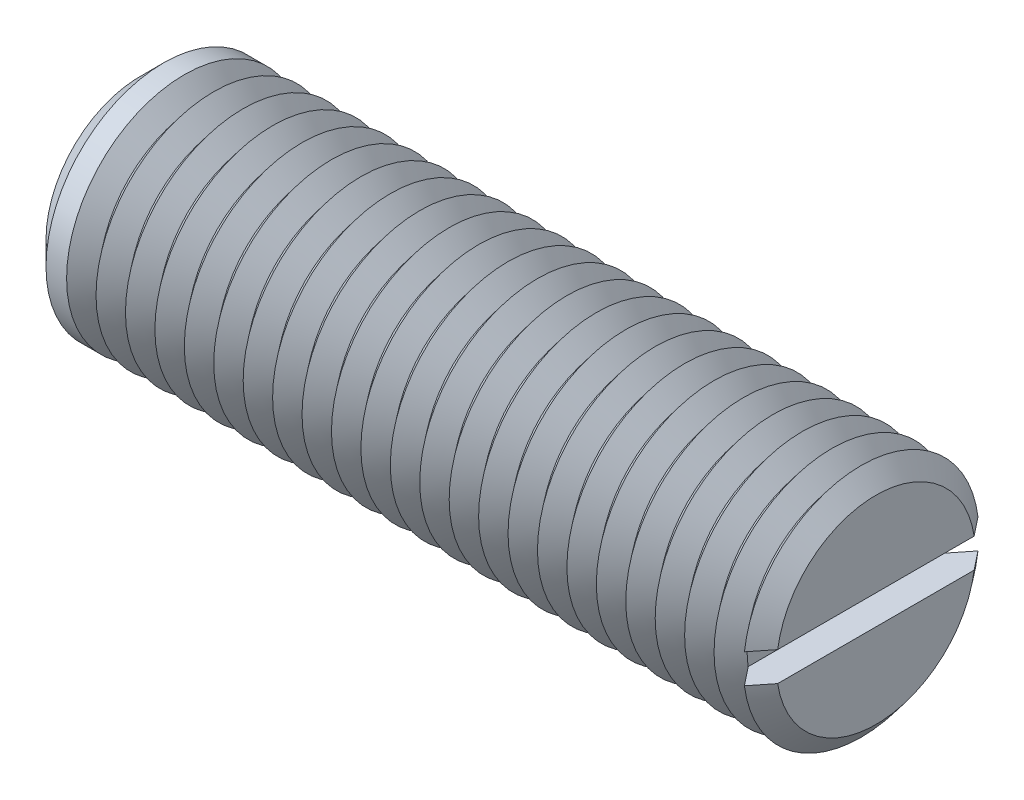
ISO-10303-21;
HEADER;
FILE_DESCRIPTION(('STEP AP214'),'2;1');
FILE_NAME('part.step','',(''),(''),'','','');
FILE_SCHEMA(('AUTOMOTIVE_DESIGN { 1 0 10303 214 1 1 1 1 }'));
ENDSEC;
DATA;
#1=APPLICATION_CONTEXT('core data for automotive mechanical design processes');
#2=APPLICATION_PROTOCOL_DEFINITION('international standard','automotive_design',2000,#1);
#3=PRODUCT_CONTEXT('',#1,'mechanical');
#4=PRODUCT('Part','Part','',(#3));
#5=PRODUCT_RELATED_PRODUCT_CATEGORY('part','',(#4));
#6=PRODUCT_DEFINITION_FORMATION('','',#4);
#7=PRODUCT_DEFINITION_CONTEXT('part definition',#1,'design');
#8=PRODUCT_DEFINITION('design','',#6,#7);
#9=PRODUCT_DEFINITION_SHAPE('','',#8);
#10=(LENGTH_UNIT() NAMED_UNIT(*) SI_UNIT(.MILLI.,.METRE.));
#11=(NAMED_UNIT(*) PLANE_ANGLE_UNIT() SI_UNIT($,.RADIAN.));
#12=(NAMED_UNIT(*) SI_UNIT($,.STERADIAN.) SOLID_ANGLE_UNIT());
#13=UNCERTAINTY_MEASURE_WITH_UNIT(LENGTH_MEASURE(1.E-05),#10,'distance_accuracy_value','');
#14=(GEOMETRIC_REPRESENTATION_CONTEXT(3) GLOBAL_UNCERTAINTY_ASSIGNED_CONTEXT((#13)) GLOBAL_UNIT_ASSIGNED_CONTEXT((#10,
#11,#12)) REPRESENTATION_CONTEXT('',''));
#15=CARTESIAN_POINT('',(0.,0.,0.));
#16=DIRECTION('',(0.,0.,1.));
#17=DIRECTION('',(1.,0.,0.));
#18=AXIS2_PLACEMENT_3D('',#15,#16,#17);
#19=CARTESIAN_POINT('',(24.,0.,0.));
#20=DIRECTION('',(1.,0.,0.));
#21=DIRECTION('',(0.,0.,-1.));
#22=AXIS2_PLACEMENT_3D('',#19,#20,#21);
#23=CONICAL_SURFACE('',#22,8.,0.895664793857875);
#24=CARTESIAN_POINT('',(24.,0.,0.));
#25=DIRECTION('',(-1.,0.,0.));
#26=DIRECTION('',(0.,0.,1.));
#27=AXIS2_PLACEMENT_3D('',#24,#25,#26);
#28=CIRCLE('',#27,8.);
#29=CARTESIAN_POINT('',(24.,-1.,-7.93725393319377));
#30=VERTEX_POINT('',#29);
#31=CARTESIAN_POINT('',(24.,-1.,7.93725393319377));
#32=VERTEX_POINT('',#31);
#33=EDGE_CURVE('E117',#30,#32,#28,.T.);
#34=ORIENTED_EDGE('',*,*,#33,.T.);
#35=CARTESIAN_POINT('',(31.6137872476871,-1.,-17.4810381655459));
#36=CARTESIAN_POINT('',(31.0731000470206,-1.,-16.8046018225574));
#37=CARTESIAN_POINT('',(30.5324624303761,-1.,-16.1281258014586));
#38=CARTESIAN_POINT('',(29.4513425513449,-1.,-14.7749910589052));
#39=CARTESIAN_POINT('',(28.9108602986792,-1.,-14.0983323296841));
#40=CARTESIAN_POINT('',(27.8295593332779,-1.,-12.7440423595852));
#41=CARTESIAN_POINT('',(27.2887409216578,-1.,-12.0664108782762));
#42=CARTESIAN_POINT('',(26.207566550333,-1.,-10.7108366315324));
#43=CARTESIAN_POINT('',(25.6672105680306,-1.,-10.0328938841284));
#44=CARTESIAN_POINT('',(24.8866021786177,-1.,-9.05235403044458));
#45=CARTESIAN_POINT('',(24.6460332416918,-1.,-8.75000893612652));
#46=CARTESIAN_POINT('',(24.1651110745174,-1.,-8.1451446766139));
#47=CARTESIAN_POINT('',(23.9247578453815,-1.,-7.8426255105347));
#48=CARTESIAN_POINT('',(23.4443170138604,-1.,-7.23730074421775));
#49=CARTESIAN_POINT('',(23.2042294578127,-1.,-6.93449510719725));
#50=CARTESIAN_POINT('',(22.7244992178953,-1.,-6.32854042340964));
#51=CARTESIAN_POINT('',(22.4848565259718,-1.,-6.02539138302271));
#52=CARTESIAN_POINT('',(22.0064209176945,-1.,-5.41876829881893));
#53=CARTESIAN_POINT('',(21.7676275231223,-1.,-5.11529463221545));
#54=CARTESIAN_POINT('',(21.291132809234,-1.,-4.50745556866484));
#55=CARTESIAN_POINT('',(21.0534315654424,-1.,-4.20309011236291));
#56=CARTESIAN_POINT('',(20.6984723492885,-1.,-3.74537358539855));
#57=CARTESIAN_POINT('',(20.5804342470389,-1.,-3.59262786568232));
#58=CARTESIAN_POINT('',(20.3451171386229,-1.,-3.28655323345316));
#59=CARTESIAN_POINT('',(20.2278381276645,-1.,-3.13322432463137));
#60=CARTESIAN_POINT('',(19.9944317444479,-1.,-2.82571819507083));
#61=CARTESIAN_POINT('',(19.8783042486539,-1.,-2.67154106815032));
#62=CARTESIAN_POINT('',(19.6478553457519,-1.,-2.36184450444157));
#63=CARTESIAN_POINT('',(19.5335338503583,-1.,-2.20632513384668));
#64=CARTESIAN_POINT('',(19.3956998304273,-1.,-2.01476175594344));
#65=CARTESIAN_POINT('',(19.3706709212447,-1.,-1.97980928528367));
#66=CARTESIAN_POINT('',(19.3208007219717,-1.,-1.90977040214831));
#67=CARTESIAN_POINT('',(19.2959594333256,-1.,-1.87468398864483));
#68=CARTESIAN_POINT('',(19.2217527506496,-1.,-1.76919140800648));
#69=CARTESIAN_POINT('',(19.1727089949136,-1.,-1.69855807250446));
#70=CARTESIAN_POINT('',(19.0751159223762,-1.,-1.55549554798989));
#71=CARTESIAN_POINT('',(19.0265831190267,-1.,-1.48305505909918));
#72=CARTESIAN_POINT('',(18.9312399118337,-1.,-1.33706835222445));
#73=CARTESIAN_POINT('',(18.8844290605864,-1.,-1.26352242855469));
#74=CARTESIAN_POINT('',(18.7926759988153,-1.,-1.1137948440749));
#75=CARTESIAN_POINT('',(18.7477706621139,-1.,-1.03759043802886));
#76=CARTESIAN_POINT('',(18.661907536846,-1.,-0.882780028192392));
#77=CARTESIAN_POINT('',(18.6209558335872,-1.,-0.804170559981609));
#78=CARTESIAN_POINT('',(18.56478469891,-1.,-0.684500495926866));
#79=CARTESIAN_POINT('',(18.5470539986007,-1.,-0.644631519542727));
#80=CARTESIAN_POINT('',(18.5136729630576,-1.,-0.564036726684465));
#81=CARTESIAN_POINT('',(18.4980230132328,-1.,-0.523310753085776));
#82=CARTESIAN_POINT('',(18.4551526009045,-1.,-0.399956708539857));
#83=CARTESIAN_POINT('',(18.4318433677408,-1.,-0.315816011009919));
#84=CARTESIAN_POINT('',(18.4098657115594,-1.,-0.193542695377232));
#85=CARTESIAN_POINT('',(18.4047261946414,-1.,-0.156548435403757));
#86=CARTESIAN_POINT('',(18.3976757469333,-1.,-0.0822397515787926));
#87=CARTESIAN_POINT('',(18.3957650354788,-1.,-0.0449253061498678));
#88=CARTESIAN_POINT('',(18.3953106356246,-1.,0.0296935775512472));
#89=CARTESIAN_POINT('',(18.3967642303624,-1.,0.0669979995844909));
#90=CARTESIAN_POINT('',(18.402929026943,-1.,0.141334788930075));
#91=CARTESIAN_POINT('',(18.4076406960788,-1.,0.178367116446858));
#92=CARTESIAN_POINT('',(18.4224195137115,-1.,0.266117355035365));
#93=CARTESIAN_POINT('',(18.4338513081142,-1.,0.316604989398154));
#94=CARTESIAN_POINT('',(18.461310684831,-1.,0.416309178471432));
#95=CARTESIAN_POINT('',(18.4773414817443,-1.,0.465524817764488));
#96=CARTESIAN_POINT('',(18.5130409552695,-1.,0.563049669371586));
#97=CARTESIAN_POINT('',(18.5327381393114,-1.,0.61134826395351));
#98=CARTESIAN_POINT('',(18.5747706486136,-1.,0.706748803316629));
#99=CARTESIAN_POINT('',(18.5971051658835,-1.,0.753851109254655));
#100=CARTESIAN_POINT('',(18.6464135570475,-1.,0.852405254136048));
#101=CARTESIAN_POINT('',(18.6736257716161,-1.,0.903736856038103));
#102=CARTESIAN_POINT('',(18.7298407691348,-1.,1.00541472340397));
#103=CARTESIAN_POINT('',(18.7588439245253,-1.,1.05576078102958));
#104=CARTESIAN_POINT('',(18.8478642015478,-1.,1.20570300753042));
#105=CARTESIAN_POINT('',(18.909851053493,-1.,1.30412495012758));
#106=CARTESIAN_POINT('',(19.0370218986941,-1.,1.49921478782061));
#107=CARTESIAN_POINT('',(19.1022138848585,-1.,1.59587737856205));
#108=CARTESIAN_POINT('',(19.234509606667,-1.,1.78781770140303));
#109=CARTESIAN_POINT('',(19.3016124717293,-1.,1.88309603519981));
#110=CARTESIAN_POINT('',(19.4371969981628,-1.,2.07285006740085));
#111=CARTESIAN_POINT('',(19.5056803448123,-1.,2.16732455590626));
#112=CARTESIAN_POINT('',(19.6435598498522,-1.,2.3556198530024));
#113=CARTESIAN_POINT('',(19.7129561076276,-1.,2.44944058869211));
#114=CARTESIAN_POINT('',(19.8522867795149,-1.,2.63643541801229));
#115=CARTESIAN_POINT('',(19.9222200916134,-1.,2.72961033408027));
#116=CARTESIAN_POINT('',(20.0625737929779,-1.,2.9155867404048));
#117=CARTESIAN_POINT('',(20.1329941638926,-1.,3.00838824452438));
#118=CARTESIAN_POINT('',(20.3434401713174,-1.,3.2845708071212));
#119=CARTESIAN_POINT('',(20.4840068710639,-1.,3.46753938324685));
#120=CARTESIAN_POINT('',(20.766047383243,-1.,3.83277652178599));
#121=CARTESIAN_POINT('',(20.9075212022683,-1.,4.01504507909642));
#122=CARTESIAN_POINT('',(21.3328445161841,-1.,4.56116633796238));
#123=CARTESIAN_POINT('',(21.6175870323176,-1.,4.92432312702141));
#124=CARTESIAN_POINT('',(22.188450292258,-1.,5.64994266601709));
#125=CARTESIAN_POINT('',(22.4745718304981,-1.,6.01240478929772));
#126=CARTESIAN_POINT('',(23.0475166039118,-1.,6.73676512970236));
#127=CARTESIAN_POINT('',(23.334339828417,-1.,7.09866335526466));
#128=CARTESIAN_POINT('',(23.9076446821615,-1.,7.8211222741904));
#129=CARTESIAN_POINT('',(24.194125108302,-1.,8.18168392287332));
#130=CARTESIAN_POINT('',(24.7673842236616,-1.,8.90257236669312));
#131=CARTESIAN_POINT('',(25.0541629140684,-1.,9.26289916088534));
#132=CARTESIAN_POINT('',(25.9146958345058,-1.,10.3434977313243));
#133=CARTESIAN_POINT('',(26.4887564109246,-1.,11.0635255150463));
#134=CARTESIAN_POINT('',(27.4416309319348,-1.,12.2579358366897));
#135=CARTESIAN_POINT('',(27.8203198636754,-1.,12.7324181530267));
#136=CARTESIAN_POINT('',(28.577860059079,-1.,13.6812951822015));
#137=CARTESIAN_POINT('',(28.9567113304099,-1.,14.1556898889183));
#138=CARTESIAN_POINT('',(29.7152320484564,-1.,15.1052923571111));
#139=CARTESIAN_POINT('',(30.0949016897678,-1.,15.5804999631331));
#140=CARTESIAN_POINT('',(30.8543004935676,-1.,16.5308253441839));
#141=CARTESIAN_POINT('',(31.2340296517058,-1.,17.005943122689));
#142=CARTESIAN_POINT('',(31.6137872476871,-1.,17.4810381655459));
#143=B_SPLINE_CURVE_WITH_KNOTS('',3,(#35,#36,#37,#38,#39,#40,#41,#42,#43,#44,#45,#46,#47,#48,
#49,#50,#51,#52,#53,#54,#55,#56,#57,#58,#59,#60,#61,#62,#63,#64,#65,#66,#67,#68,#69,#70,#71,#72,
#73,#74,#75,#76,#77,#78,#79,#80,#81,#82,#83,#84,#85,#86,#87,#88,#89,#90,#91,#92,#93,#94,#95,#96,
#97,#98,#99,#100,#101,#102,#103,#104,#105,#106,#107,#108,#109,#110,#111,#112,#113,#114,#115,
#116,#117,#118,#119,#120,#121,#122,#123,#124,#125,#126,#127,#128,#129,#130,#131,#132,#133,#134,
#135,#136,#137,#138,#139,#140,#141,#142),.UNSPECIFIED.,.F.,.F.,(4,2,2,2,2,2,2,2,2,2,2,2,2,2,2,2,
2,2,2,2,2,2,2,2,2,2,2,2,2,2,2,2,2,2,2,2,2,2,2,2,2,2,2,2,2,2,2,2,2,2,2,2,2,4),(0.,
2.59791825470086,5.19597381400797,7.79693910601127,10.3977690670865,11.5568952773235,
12.7160274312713,13.8753371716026,15.0346257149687,16.1931009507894,17.3516551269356,
17.9307722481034,18.5098857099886,19.0889363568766,19.6679586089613,19.7969273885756,
19.9258971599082,20.1838595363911,20.4454304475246,20.7069329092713,20.9722220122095,
21.2379131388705,21.3687577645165,21.4996265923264,21.7602408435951,21.8721711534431,
21.9841090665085,22.0959566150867,22.2078202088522,22.3628274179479,22.5179432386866,
22.6743197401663,22.8306484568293,23.0048946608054,23.1791772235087,23.5280071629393,
23.8777561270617,24.2273482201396,24.5773965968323,24.927483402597,25.2769811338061,
25.6264657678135,26.3186514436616,27.0108421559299,28.3952670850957,29.7806179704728,
31.1659479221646,32.5474981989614,33.9290539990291,36.6916375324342,38.5128593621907,
40.334179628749,42.1589376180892,43.9835965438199),.UNSPECIFIED.);
#144=CARTESIAN_POINT('',(23.,-1.,6.67652652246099));
#145=VERTEX_POINT('',#144);
#146=EDGE_CURVE('E109',#145,#32,#143,.T.);
#147=ORIENTED_EDGE('',*,*,#146,.F.);
#148=CARTESIAN_POINT('',(23.,0.,0.));
#149=DIRECTION('',(-1.,0.,0.));
#150=DIRECTION('',(0.,0.,1.));
#151=AXIS2_PLACEMENT_3D('',#148,#149,#150);
#152=CIRCLE('',#151,6.75100040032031);
#153=CARTESIAN_POINT('',(23.,-1.,-6.67652652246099));
#154=VERTEX_POINT('',#153);
#155=EDGE_CURVE('E409',#154,#145,#152,.T.);
#156=ORIENTED_EDGE('',*,*,#155,.F.);
#157=EDGE_CURVE('E58',#30,#154,#143,.T.);
#158=ORIENTED_EDGE('',*,*,#157,.F.);
#159=EDGE_LOOP('',(#34,#147,#156,#158));
#160=FACE_BOUND('',#159,.T.);
#161=ADVANCED_FACE('F37',(#160),#23,.T.);
#162=CARTESIAN_POINT('',(24.,1.,7.93725393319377));
#163=VERTEX_POINT('',#162);
#164=CARTESIAN_POINT('',(24.,1.,-7.93725393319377));
#165=VERTEX_POINT('',#164);
#166=EDGE_CURVE('E100',#163,#165,#28,.T.);
#167=ORIENTED_EDGE('',*,*,#166,.T.);
#168=CARTESIAN_POINT('',(31.6137872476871,1.,17.4810381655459));
#169=CARTESIAN_POINT('',(31.0731000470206,1.,16.8046018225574));
#170=CARTESIAN_POINT('',(30.5324624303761,1.,16.1281258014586));
#171=CARTESIAN_POINT('',(29.4513425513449,1.,14.7749910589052));
#172=CARTESIAN_POINT('',(28.9108602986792,1.,14.0983323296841));
#173=CARTESIAN_POINT('',(27.8295593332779,1.,12.7440423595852));
#174=CARTESIAN_POINT('',(27.2887409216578,1.,12.0664108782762));
#175=CARTESIAN_POINT('',(26.207566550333,1.,10.7108366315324));
#176=CARTESIAN_POINT('',(25.6672105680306,1.,10.0328938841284));
#177=CARTESIAN_POINT('',(24.8866021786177,1.,9.05235403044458));
#178=CARTESIAN_POINT('',(24.6460332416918,1.,8.75000893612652));
#179=CARTESIAN_POINT('',(24.1651110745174,1.,8.1451446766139));
#180=CARTESIAN_POINT('',(23.9247578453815,1.,7.8426255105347));
#181=CARTESIAN_POINT('',(23.4443170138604,1.,7.23730074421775));
#182=CARTESIAN_POINT('',(23.2042294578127,1.,6.93449510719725));
#183=CARTESIAN_POINT('',(22.7244992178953,1.,6.32854042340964));
#184=CARTESIAN_POINT('',(22.4848565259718,1.,6.02539138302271));
#185=CARTESIAN_POINT('',(22.0064209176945,1.,5.41876829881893));
#186=CARTESIAN_POINT('',(21.7676275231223,1.,5.11529463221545));
#187=CARTESIAN_POINT('',(21.291132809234,1.,4.50745556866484));
#188=CARTESIAN_POINT('',(21.0534315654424,1.,4.20309011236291));
#189=CARTESIAN_POINT('',(20.6984723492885,1.,3.74537358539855));
#190=CARTESIAN_POINT('',(20.5804342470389,1.,3.59262786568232));
#191=CARTESIAN_POINT('',(20.3451171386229,1.,3.28655323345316));
#192=CARTESIAN_POINT('',(20.2278381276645,1.,3.13322432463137));
#193=CARTESIAN_POINT('',(19.9944317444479,1.,2.82571819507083));
#194=CARTESIAN_POINT('',(19.8783042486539,1.,2.67154106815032));
#195=CARTESIAN_POINT('',(19.6478553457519,1.,2.36184450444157));
#196=CARTESIAN_POINT('',(19.5335338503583,1.,2.20632513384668));
#197=CARTESIAN_POINT('',(19.3956998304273,1.,2.01476175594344));
#198=CARTESIAN_POINT('',(19.3706709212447,1.,1.97980928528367));
#199=CARTESIAN_POINT('',(19.3208007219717,1.,1.90977040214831));
#200=CARTESIAN_POINT('',(19.2959594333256,1.,1.87468398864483));
#201=CARTESIAN_POINT('',(19.2217527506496,1.,1.76919140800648));
#202=CARTESIAN_POINT('',(19.1727089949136,1.,1.69855807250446));
#203=CARTESIAN_POINT('',(19.0751159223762,1.,1.55549554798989));
#204=CARTESIAN_POINT('',(19.0265831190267,1.,1.48305505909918));
#205=CARTESIAN_POINT('',(18.9312399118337,1.,1.33706835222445));
#206=CARTESIAN_POINT('',(18.8844290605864,1.,1.26352242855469));
#207=CARTESIAN_POINT('',(18.7926759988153,1.,1.1137948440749));
#208=CARTESIAN_POINT('',(18.7477706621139,1.,1.03759043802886));
#209=CARTESIAN_POINT('',(18.661907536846,1.,0.882780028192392));
#210=CARTESIAN_POINT('',(18.6209558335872,1.,0.804170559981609));
#211=CARTESIAN_POINT('',(18.56478469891,1.,0.684500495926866));
#212=CARTESIAN_POINT('',(18.5470539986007,1.,0.644631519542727));
#213=CARTESIAN_POINT('',(18.5136729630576,1.,0.564036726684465));
#214=CARTESIAN_POINT('',(18.4980230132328,1.,0.523310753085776));
#215=CARTESIAN_POINT('',(18.4551526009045,1.,0.399956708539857));
#216=CARTESIAN_POINT('',(18.4318433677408,1.,0.315816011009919));
#217=CARTESIAN_POINT('',(18.4098657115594,1.,0.193542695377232));
#218=CARTESIAN_POINT('',(18.4047261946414,1.,0.156548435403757));
#219=CARTESIAN_POINT('',(18.3976757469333,1.,0.0822397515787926));
#220=CARTESIAN_POINT('',(18.3957650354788,1.,0.0449253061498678));
#221=CARTESIAN_POINT('',(18.3953106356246,1.,-0.0296935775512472));
#222=CARTESIAN_POINT('',(18.3967642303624,1.,-0.0669979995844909));
#223=CARTESIAN_POINT('',(18.402929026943,1.,-0.141334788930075));
#224=CARTESIAN_POINT('',(18.4076406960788,1.,-0.178367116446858));
#225=CARTESIAN_POINT('',(18.4224195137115,1.,-0.266117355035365));
#226=CARTESIAN_POINT('',(18.4338513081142,1.,-0.316604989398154));
#227=CARTESIAN_POINT('',(18.461310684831,1.,-0.416309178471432));
#228=CARTESIAN_POINT('',(18.4773414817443,1.,-0.465524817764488));
#229=CARTESIAN_POINT('',(18.5130409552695,1.,-0.563049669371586));
#230=CARTESIAN_POINT('',(18.5327381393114,1.,-0.61134826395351));
#231=CARTESIAN_POINT('',(18.5747706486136,1.,-0.706748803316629));
#232=CARTESIAN_POINT('',(18.5971051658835,1.,-0.753851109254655));
#233=CARTESIAN_POINT('',(18.6464135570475,1.,-0.852405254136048));
#234=CARTESIAN_POINT('',(18.6736257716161,1.,-0.903736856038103));
#235=CARTESIAN_POINT('',(18.7298407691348,1.,-1.00541472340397));
#236=CARTESIAN_POINT('',(18.7588439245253,1.,-1.05576078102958));
#237=CARTESIAN_POINT('',(18.8478642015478,1.,-1.20570300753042));
#238=CARTESIAN_POINT('',(18.909851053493,1.,-1.30412495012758));
#239=CARTESIAN_POINT('',(19.0370218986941,1.,-1.49921478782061));
#240=CARTESIAN_POINT('',(19.1022138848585,1.,-1.59587737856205));
#241=CARTESIAN_POINT('',(19.234509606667,1.,-1.78781770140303));
#242=CARTESIAN_POINT('',(19.3016124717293,1.,-1.88309603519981));
#243=CARTESIAN_POINT('',(19.4371969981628,1.,-2.07285006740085));
#244=CARTESIAN_POINT('',(19.5056803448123,1.,-2.16732455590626));
#245=CARTESIAN_POINT('',(19.6435598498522,1.,-2.3556198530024));
#246=CARTESIAN_POINT('',(19.7129561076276,1.,-2.44944058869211));
#247=CARTESIAN_POINT('',(19.8522867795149,1.,-2.63643541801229));
#248=CARTESIAN_POINT('',(19.9222200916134,1.,-2.72961033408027));
#249=CARTESIAN_POINT('',(20.0625737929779,1.,-2.9155867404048));
#250=CARTESIAN_POINT('',(20.1329941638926,1.,-3.00838824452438));
#251=CARTESIAN_POINT('',(20.3434401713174,1.,-3.2845708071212));
#252=CARTESIAN_POINT('',(20.4840068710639,1.,-3.46753938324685));
#253=CARTESIAN_POINT('',(20.766047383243,1.,-3.83277652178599));
#254=CARTESIAN_POINT('',(20.9075212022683,1.,-4.01504507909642));
#255=CARTESIAN_POINT('',(21.3328445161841,1.,-4.56116633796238));
#256=CARTESIAN_POINT('',(21.6175870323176,1.,-4.92432312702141));
#257=CARTESIAN_POINT('',(22.188450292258,1.,-5.64994266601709));
#258=CARTESIAN_POINT('',(22.4745718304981,1.,-6.01240478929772));
#259=CARTESIAN_POINT('',(23.0475166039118,1.,-6.73676512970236));
#260=CARTESIAN_POINT('',(23.334339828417,1.,-7.09866335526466));
#261=CARTESIAN_POINT('',(23.9076446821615,1.,-7.8211222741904));
#262=CARTESIAN_POINT('',(24.194125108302,1.,-8.18168392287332));
#263=CARTESIAN_POINT('',(24.7673842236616,1.,-8.90257236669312));
#264=CARTESIAN_POINT('',(25.0541629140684,1.,-9.26289916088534));
#265=CARTESIAN_POINT('',(25.9146958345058,1.,-10.3434977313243));
#266=CARTESIAN_POINT('',(26.4887564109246,1.,-11.0635255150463));
#267=CARTESIAN_POINT('',(27.4416309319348,1.,-12.2579358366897));
#268=CARTESIAN_POINT('',(27.8203198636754,1.,-12.7324181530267));
#269=CARTESIAN_POINT('',(28.577860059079,1.,-13.6812951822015));
#270=CARTESIAN_POINT('',(28.9567113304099,1.,-14.1556898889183));
#271=CARTESIAN_POINT('',(29.7152320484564,1.,-15.1052923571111));
#272=CARTESIAN_POINT('',(30.0949016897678,1.,-15.5804999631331));
#273=CARTESIAN_POINT('',(30.8543004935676,1.,-16.5308253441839));
#274=CARTESIAN_POINT('',(31.2340296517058,1.,-17.005943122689));
#275=CARTESIAN_POINT('',(31.6137872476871,1.,-17.4810381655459));
#276=B_SPLINE_CURVE_WITH_KNOTS('',3,(#168,#169,#170,#171,#172,#173,#174,#175,#176,#177,#178,
#179,#180,#181,#182,#183,#184,#185,#186,#187,#188,#189,#190,#191,#192,#193,#194,#195,#196,#197,
#198,#199,#200,#201,#202,#203,#204,#205,#206,#207,#208,#209,#210,#211,#212,#213,#214,#215,#216,
#217,#218,#219,#220,#221,#222,#223,#224,#225,#226,#227,#228,#229,#230,#231,#232,#233,#234,#235,
#236,#237,#238,#239,#240,#241,#242,#243,#244,#245,#246,#247,#248,#249,#250,#251,#252,#253,#254,
#255,#256,#257,#258,#259,#260,#261,#262,#263,#264,#265,#266,#267,#268,#269,#270,#271,#272,#273,
#274,#275),.UNSPECIFIED.,.F.,.F.,(4,2,2,2,2,2,2,2,2,2,2,2,2,2,2,2,2,2,2,2,2,2,2,2,2,2,2,2,2,2,2,
2,2,2,2,2,2,2,2,2,2,2,2,2,2,2,2,2,2,2,2,2,2,4),(0.,2.59791825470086,5.19597381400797,
7.79693910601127,10.3977690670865,11.5568952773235,12.7160274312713,13.8753371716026,
15.0346257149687,16.1931009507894,17.3516551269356,17.9307722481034,18.5098857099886,
19.0889363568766,19.6679586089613,19.7969273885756,19.9258971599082,20.1838595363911,
20.4454304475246,20.7069329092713,20.9722220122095,21.2379131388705,21.3687577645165,
21.4996265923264,21.7602408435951,21.8721711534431,21.9841090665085,22.0959566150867,
22.2078202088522,22.3628274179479,22.5179432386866,22.6743197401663,22.8306484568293,
23.0048946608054,23.1791772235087,23.5280071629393,23.8777561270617,24.2273482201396,
24.5773965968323,24.927483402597,25.2769811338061,25.6264657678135,26.3186514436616,
27.0108421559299,28.3952670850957,29.7806179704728,31.1659479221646,32.5474981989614,
33.9290539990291,36.6916375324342,38.5128593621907,40.334179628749,42.1589376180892,
43.9835965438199),.UNSPECIFIED.);
#277=CARTESIAN_POINT('',(23.,1.,-6.67652652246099));
#278=VERTEX_POINT('',#277);
#279=EDGE_CURVE('E110',#278,#165,#276,.T.);
#280=ORIENTED_EDGE('',*,*,#279,.F.);
#281=CARTESIAN_POINT('',(23.,1.,6.67652652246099));
#282=VERTEX_POINT('',#281);
#283=EDGE_CURVE('E103',#282,#278,#152,.T.);
#284=ORIENTED_EDGE('',*,*,#283,.F.);
#285=EDGE_CURVE('E97',#163,#282,#276,.T.);
#286=ORIENTED_EDGE('',*,*,#285,.F.);
#287=EDGE_LOOP('',(#167,#280,#284,#286));
#288=FACE_BOUND('',#287,.T.);
#289=ADVANCED_FACE('F99',(#288),#23,.T.);
#290=CARTESIAN_POINT('',(23.,0.,0.));
#291=DIRECTION('',(-1.,0.,0.));
#292=DIRECTION('',(0.,0.,1.));
#293=AXIS2_PLACEMENT_3D('',#290,#291,#292);
#294=CONICAL_SURFACE('',#293,6.75100040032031,0.895664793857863);
#295=CARTESIAN_POINT('',(22.,0.,0.));
#296=DIRECTION('',(-1.,0.,0.));
#297=DIRECTION('',(0.,0.,1.));
#298=AXIS2_PLACEMENT_3D('',#295,#296,#297);
#299=CIRCLE('',#298,8.);
#300=CARTESIAN_POINT('',(22.,0.,8.));
#301=VERTEX_POINT('',#300);
#302=EDGE_CURVE('E395',#301,#301,#299,.T.);
#303=ORIENTED_EDGE('',*,*,#302,.F.);
#304=EDGE_LOOP('',(#303));
#305=FACE_BOUND('',#304,.T.);
#306=ORIENTED_EDGE('',*,*,#283,.T.);
#307=EDGE_CURVE('E404',#278,#154,#152,.T.);
#308=ORIENTED_EDGE('',*,*,#307,.T.);
#309=ORIENTED_EDGE('',*,*,#155,.T.);
#310=EDGE_CURVE('E402',#145,#282,#152,.T.);
#311=ORIENTED_EDGE('',*,*,#310,.T.);
#312=EDGE_LOOP('',(#306,#308,#309,#311));
#313=FACE_BOUND('',#312,.T.);
#314=ADVANCED_FACE('F168',(#305,#313),#294,.T.);
#315=CARTESIAN_POINT('',(25.,0.,0.));
#316=DIRECTION('',(1.,0.,0.));
#317=DIRECTION('',(0.,0.,-1.));
#318=AXIS2_PLACEMENT_3D('',#315,#316,#317);
#319=PLANE('',#318);
#320=CARTESIAN_POINT('',(25.,0.,0.));
#321=DIRECTION('',(-1.,0.,0.));
#322=DIRECTION('',(0.,0.,1.));
#323=AXIS2_PLACEMENT_3D('',#320,#321,#322);
#324=CIRCLE('',#323,6.75100040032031);
#325=CARTESIAN_POINT('',(25.,1.,6.67652652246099));
#326=VERTEX_POINT('',#325);
#327=CARTESIAN_POINT('',(25.,1.,-6.67652652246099));
#328=VERTEX_POINT('',#327);
#329=EDGE_CURVE('E160',#326,#328,#324,.T.);
#330=ORIENTED_EDGE('',*,*,#329,.F.);
#331=DIRECTION('',(0.,0.,1.));
#332=VECTOR('',#331,1.);
#333=CARTESIAN_POINT('',(25.,1.,0.));
#334=LINE('',#333,#332);
#335=EDGE_CURVE('E122',#328,#326,#334,.T.);
#336=ORIENTED_EDGE('',*,*,#335,.F.);
#337=EDGE_LOOP('',(#330,#336));
#338=FACE_BOUND('',#337,.T.);
#339=ADVANCED_FACE('F172',(#338),#319,.T.);
#340=CARTESIAN_POINT('',(25.,-1.,-6.67652652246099));
#341=VERTEX_POINT('',#340);
#342=CARTESIAN_POINT('',(25.,-1.,6.67652652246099));
#343=VERTEX_POINT('',#342);
#344=EDGE_CURVE('E66',#341,#343,#324,.T.);
#345=ORIENTED_EDGE('',*,*,#344,.F.);
#346=DIRECTION('',(0.,0.,-1.));
#347=VECTOR('',#346,1.);
#348=CARTESIAN_POINT('',(25.,-1.,0.));
#349=LINE('',#348,#347);
#350=EDGE_CURVE('E136',#343,#341,#349,.T.);
#351=ORIENTED_EDGE('',*,*,#350,.F.);
#352=EDGE_LOOP('',(#345,#351));
#353=FACE_BOUND('',#352,.T.);
#354=ADVANCED_FACE('F201',(#353),#319,.T.);
#355=CARTESIAN_POINT('',(25.,0.,0.));
#356=DIRECTION('',(-1.,0.,0.));
#357=DIRECTION('',(0.,0.,1.));
#358=AXIS2_PLACEMENT_3D('',#355,#356,#357);
#359=CONICAL_SURFACE('',#358,6.75100040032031,0.895664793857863);
#360=ORIENTED_EDGE('',*,*,#166,.F.);
#361=CARTESIAN_POINT('',(16.3862127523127,1.,-17.4810381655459));
#362=CARTESIAN_POINT('',(16.9268999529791,1.,-16.8046018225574));
#363=CARTESIAN_POINT('',(17.4675375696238,1.,-16.1281258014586));
#364=CARTESIAN_POINT('',(18.5486574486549,1.,-14.7749910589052));
#365=CARTESIAN_POINT('',(19.0891397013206,1.,-14.0983323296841));
#366=CARTESIAN_POINT('',(20.1704406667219,1.,-12.7440423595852));
#367=CARTESIAN_POINT('',(20.711259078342,1.,-12.0664108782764));
#368=CARTESIAN_POINT('',(21.7924334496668,1.,-10.7108366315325));
#369=CARTESIAN_POINT('',(22.3327894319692,1.,-10.0328938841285));
#370=CARTESIAN_POINT('',(23.1133978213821,1.,-9.05235403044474));
#371=CARTESIAN_POINT('',(23.3539667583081,1.,-8.75000893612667));
#372=CARTESIAN_POINT('',(23.8348889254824,1.,-8.14514467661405));
#373=CARTESIAN_POINT('',(24.0752421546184,1.,-7.84262551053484));
#374=CARTESIAN_POINT('',(24.5556829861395,1.,-7.23730074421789));
#375=CARTESIAN_POINT('',(24.7957705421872,1.,-6.93449510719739));
#376=CARTESIAN_POINT('',(25.2755007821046,1.,-6.32854042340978));
#377=CARTESIAN_POINT('',(25.5151434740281,1.,-6.02539138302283));
#378=CARTESIAN_POINT('',(25.9935790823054,1.,-5.41876829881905));
#379=CARTESIAN_POINT('',(26.2323724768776,1.,-5.11529463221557));
#380=CARTESIAN_POINT('',(26.708867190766,1.,-4.50745556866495));
#381=CARTESIAN_POINT('',(26.9465684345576,1.,-4.20309011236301));
#382=CARTESIAN_POINT('',(27.3015276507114,1.,-3.74537358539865));
#383=CARTESIAN_POINT('',(27.419565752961,1.,-3.59262786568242));
#384=CARTESIAN_POINT('',(27.6548828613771,1.,-3.28655323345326));
#385=CARTESIAN_POINT('',(27.7721618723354,1.,-3.13322432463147));
#386=CARTESIAN_POINT('',(28.0055682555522,1.,-2.82571819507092));
#387=CARTESIAN_POINT('',(28.1216957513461,1.,-2.6715410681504));
#388=CARTESIAN_POINT('',(28.3521446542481,1.,-2.36184450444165));
#389=CARTESIAN_POINT('',(28.4664661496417,1.,-2.20632513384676));
#390=CARTESIAN_POINT('',(28.6043001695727,1.,-2.01476175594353));
#391=CARTESIAN_POINT('',(28.6293290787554,1.,-1.97980928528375));
#392=CARTESIAN_POINT('',(28.6791992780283,1.,-1.90977040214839));
#393=CARTESIAN_POINT('',(28.7040405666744,1.,-1.87468398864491));
#394=CARTESIAN_POINT('',(28.7782472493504,1.,-1.76919140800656));
#395=CARTESIAN_POINT('',(28.8272910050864,1.,-1.69855807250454));
#396=CARTESIAN_POINT('',(28.9248840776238,1.,-1.55549554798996));
#397=CARTESIAN_POINT('',(28.9734168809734,1.,-1.48305505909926));
#398=CARTESIAN_POINT('',(29.0687600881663,1.,-1.33706835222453));
#399=CARTESIAN_POINT('',(29.1155709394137,1.,-1.26352242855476));
#400=CARTESIAN_POINT('',(29.2073240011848,1.,-1.11379484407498));
#401=CARTESIAN_POINT('',(29.2522293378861,1.,-1.03759043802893));
#402=CARTESIAN_POINT('',(29.338092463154,1.,-0.882780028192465));
#403=CARTESIAN_POINT('',(29.3790441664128,1.,-0.804170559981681));
#404=CARTESIAN_POINT('',(29.4352153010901,1.,-0.684500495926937));
#405=CARTESIAN_POINT('',(29.4529460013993,1.,-0.644631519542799));
#406=CARTESIAN_POINT('',(29.4863270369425,1.,-0.564036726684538));
#407=CARTESIAN_POINT('',(29.5019769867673,1.,-0.523310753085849));
#408=CARTESIAN_POINT('',(29.5448473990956,1.,-0.399956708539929));
#409=CARTESIAN_POINT('',(29.5681566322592,1.,-0.315816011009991));
#410=CARTESIAN_POINT('',(29.5901342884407,1.,-0.193542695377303));
#411=CARTESIAN_POINT('',(29.5952738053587,1.,-0.156548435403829));
#412=CARTESIAN_POINT('',(29.6023242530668,1.,-0.0822397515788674));
#413=CARTESIAN_POINT('',(29.6042349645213,1.,-0.044925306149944));
#414=CARTESIAN_POINT('',(29.6046893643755,1.,0.0296935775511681));
#415=CARTESIAN_POINT('',(29.6032357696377,1.,0.0669979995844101));
#416=CARTESIAN_POINT('',(29.5970709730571,1.,0.141334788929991));
#417=CARTESIAN_POINT('',(29.5923593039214,1.,0.178367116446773));
#418=CARTESIAN_POINT('',(29.5775804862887,1.,0.266117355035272));
#419=CARTESIAN_POINT('',(29.5661486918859,1.,0.316604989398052));
#420=CARTESIAN_POINT('',(29.5386893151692,1.,0.416309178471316));
#421=CARTESIAN_POINT('',(29.5226585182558,1.,0.465524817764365));
#422=CARTESIAN_POINT('',(29.4869590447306,1.,0.563049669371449));
#423=CARTESIAN_POINT('',(29.4672618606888,1.,0.611348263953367));
#424=CARTESIAN_POINT('',(29.4252293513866,1.,0.706748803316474));
#425=CARTESIAN_POINT('',(29.4028948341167,1.,0.753851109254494));
#426=CARTESIAN_POINT('',(29.3535864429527,1.,0.85240525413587));
#427=CARTESIAN_POINT('',(29.3263742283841,1.,0.903736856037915));
#428=CARTESIAN_POINT('',(29.2701592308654,1.,1.00541472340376));
#429=CARTESIAN_POINT('',(29.2411560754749,1.,1.05576078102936));
#430=CARTESIAN_POINT('',(29.1521357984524,1.,1.20570300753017));
#431=CARTESIAN_POINT('',(29.0901489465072,1.,1.30412495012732));
#432=CARTESIAN_POINT('',(28.9629781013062,1.,1.4992147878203));
#433=CARTESIAN_POINT('',(28.8977861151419,1.,1.59587737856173));
#434=CARTESIAN_POINT('',(28.7654903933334,1.,1.78781770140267));
#435=CARTESIAN_POINT('',(28.698387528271,1.,1.88309603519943));
#436=CARTESIAN_POINT('',(28.5628030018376,1.,2.07285006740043));
#437=CARTESIAN_POINT('',(28.4943196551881,1.,2.16732455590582));
#438=CARTESIAN_POINT('',(28.3564401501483,1.,2.35561985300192));
#439=CARTESIAN_POINT('',(28.2870438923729,1.,2.44944058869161));
#440=CARTESIAN_POINT('',(28.1477132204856,1.,2.63643541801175));
#441=CARTESIAN_POINT('',(28.077779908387,1.,2.72961033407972));
#442=CARTESIAN_POINT('',(27.9374262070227,1.,2.9155867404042));
#443=CARTESIAN_POINT('',(27.8670058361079,1.,3.00838824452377));
#444=CARTESIAN_POINT('',(27.6565598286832,1.,3.28457080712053));
#445=CARTESIAN_POINT('',(27.5159931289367,1.,3.46753938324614));
#446=CARTESIAN_POINT('',(27.2339526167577,1.,3.8327765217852));
#447=CARTESIAN_POINT('',(27.0924787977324,1.,4.01504507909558));
#448=CARTESIAN_POINT('',(26.6671554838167,1.,4.56116633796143));
#449=CARTESIAN_POINT('',(26.3824129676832,1.,4.92432312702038));
#450=CARTESIAN_POINT('',(25.811549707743,1.,5.6499426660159));
#451=CARTESIAN_POINT('',(25.5254281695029,1.,6.01240478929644));
#452=CARTESIAN_POINT('',(24.9524833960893,1.,6.73676512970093));
#453=CARTESIAN_POINT('',(24.6656601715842,1.,7.09866335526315));
#454=CARTESIAN_POINT('',(24.0923553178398,1.,7.82112227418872));
#455=CARTESIAN_POINT('',(23.8058748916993,1.,8.18168392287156));
#456=CARTESIAN_POINT('',(23.2326157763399,1.,8.90257236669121));
#457=CARTESIAN_POINT('',(22.9458370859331,1.,9.26289916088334));
#458=CARTESIAN_POINT('',(22.0853041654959,1.,10.3434977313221));
#459=CARTESIAN_POINT('',(21.5112435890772,1.,11.0635255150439));
#460=CARTESIAN_POINT('',(20.558369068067,1.,12.2579358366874));
#461=CARTESIAN_POINT('',(20.1796801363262,1.,12.7324181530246));
#462=CARTESIAN_POINT('',(19.4221399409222,1.,13.6812951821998));
#463=CARTESIAN_POINT('',(19.0432886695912,1.,14.1556898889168));
#464=CARTESIAN_POINT('',(18.2847679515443,1.,15.10529235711));
#465=CARTESIAN_POINT('',(17.9050983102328,1.,15.5804999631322));
#466=CARTESIAN_POINT('',(17.1456995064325,1.,16.5308253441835));
#467=CARTESIAN_POINT('',(16.7659703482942,1.,17.0059431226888));
#468=CARTESIAN_POINT('',(16.3862127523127,1.,17.4810381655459));
#469=B_SPLINE_CURVE_WITH_KNOTS('',3,(#361,#362,#363,#364,#365,#366,#367,#368,#369,#370,#371,
#372,#373,#374,#375,#376,#377,#378,#379,#380,#381,#382,#383,#384,#385,#386,#387,#388,#389,#390,
#391,#392,#393,#394,#395,#396,#397,#398,#399,#400,#401,#402,#403,#404,#405,#406,#407,#408,#409,
#410,#411,#412,#413,#414,#415,#416,#417,#418,#419,#420,#421,#422,#423,#424,#425,#426,#427,#428,
#429,#430,#431,#432,#433,#434,#435,#436,#437,#438,#439,#440,#441,#442,#443,#444,#445,#446,#447,
#448,#449,#450,#451,#452,#453,#454,#455,#456,#457,#458,#459,#460,#461,#462,#463,#464,#465,#466,
#467,#468),.UNSPECIFIED.,.F.,.F.,(4,2,2,2,2,2,2,2,2,2,2,2,2,2,2,2,2,2,2,2,2,2,2,2,2,2,2,2,2,2,2,
2,2,2,2,2,2,2,2,2,2,2,2,2,2,2,2,2,2,2,2,2,2,4),(0.,2.59791825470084,5.19597381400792,
7.79693910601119,10.3977690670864,11.5568952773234,12.7160274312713,13.8753371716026,
15.0346257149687,16.1931009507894,17.3516551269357,17.9307722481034,18.5098857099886,
19.0889363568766,19.6679586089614,19.7969273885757,19.9258971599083,20.1838595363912,
20.4454304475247,20.7069329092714,20.9722220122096,21.2379131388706,21.3687577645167,
21.4996265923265,21.7602408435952,21.8721711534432,21.9841090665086,22.0959566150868,
22.2078202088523,22.362827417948,22.5179432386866,22.6743197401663,22.8306484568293,
23.0048946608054,23.1791772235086,23.5280071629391,23.8777561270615,24.2273482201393,
24.577396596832,24.9274834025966,25.2769811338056,25.6264657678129,26.3186514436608,
27.0108421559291,28.3952670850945,29.7806179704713,31.1659479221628,32.5474981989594,
33.9290539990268,36.6916375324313,38.5128593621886,40.3341796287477,42.1589376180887,
43.9835965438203),.UNSPECIFIED.);
#470=EDGE_CURVE('E41',#326,#163,#469,.T.);
#471=ORIENTED_EDGE('',*,*,#470,.F.);
#472=ORIENTED_EDGE('',*,*,#329,.T.);
#473=EDGE_CURVE('E11',#165,#328,#469,.T.);
#474=ORIENTED_EDGE('',*,*,#473,.F.);
#475=EDGE_LOOP('',(#360,#471,#472,#474));
#476=FACE_BOUND('',#475,.T.);
#477=ADVANCED_FACE('F114',(#476),#359,.T.);
#478=CARTESIAN_POINT('',(25.,1.,-12.));
#479=DIRECTION('',(0.,1.,0.));
#480=DIRECTION('',(0.,0.,1.));
#481=AXIS2_PLACEMENT_3D('',#478,#479,#480);
#482=PLANE('',#481);
#483=ORIENTED_EDGE('',*,*,#470,.T.);
#484=ORIENTED_EDGE('',*,*,#285,.T.);
#485=DIRECTION('',(0.,0.,1.));
#486=VECTOR('',#485,1.);
#487=CARTESIAN_POINT('',(23.,1.,-12.));
#488=LINE('',#487,#486);
#489=EDGE_CURVE('E145',#278,#282,#488,.T.);
#490=ORIENTED_EDGE('',*,*,#489,.F.);
#491=ORIENTED_EDGE('',*,*,#279,.T.);
#492=ORIENTED_EDGE('',*,*,#473,.T.);
#493=ORIENTED_EDGE('',*,*,#335,.T.);
#494=EDGE_LOOP('',(#483,#484,#490,#491,#492,#493));
#495=FACE_BOUND('',#494,.T.);
#496=ADVANCED_FACE('F120',(#495),#482,.F.);
#497=ORIENTED_EDGE('',*,*,#33,.F.);
#498=CARTESIAN_POINT('',(16.3862127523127,-1.,17.4810381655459));
#499=CARTESIAN_POINT('',(16.9268999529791,-1.,16.8046018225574));
#500=CARTESIAN_POINT('',(17.4675375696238,-1.,16.1281258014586));
#501=CARTESIAN_POINT('',(18.5486574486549,-1.,14.7749910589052));
#502=CARTESIAN_POINT('',(19.0891397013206,-1.,14.0983323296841));
#503=CARTESIAN_POINT('',(20.1704406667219,-1.,12.7440423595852));
#504=CARTESIAN_POINT('',(20.711259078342,-1.,12.0664108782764));
#505=CARTESIAN_POINT('',(21.7924334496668,-1.,10.7108366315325));
#506=CARTESIAN_POINT('',(22.3327894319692,-1.,10.0328938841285));
#507=CARTESIAN_POINT('',(23.1133978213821,-1.,9.05235403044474));
#508=CARTESIAN_POINT('',(23.3539667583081,-1.,8.75000893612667));
#509=CARTESIAN_POINT('',(23.8348889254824,-1.,8.14514467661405));
#510=CARTESIAN_POINT('',(24.0752421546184,-1.,7.84262551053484));
#511=CARTESIAN_POINT('',(24.5556829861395,-1.,7.23730074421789));
#512=CARTESIAN_POINT('',(24.7957705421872,-1.,6.93449510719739));
#513=CARTESIAN_POINT('',(25.2755007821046,-1.,6.32854042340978));
#514=CARTESIAN_POINT('',(25.5151434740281,-1.,6.02539138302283));
#515=CARTESIAN_POINT('',(25.9935790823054,-1.,5.41876829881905));
#516=CARTESIAN_POINT('',(26.2323724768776,-1.,5.11529463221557));
#517=CARTESIAN_POINT('',(26.708867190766,-1.,4.50745556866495));
#518=CARTESIAN_POINT('',(26.9465684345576,-1.,4.20309011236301));
#519=CARTESIAN_POINT('',(27.3015276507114,-1.,3.74537358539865));
#520=CARTESIAN_POINT('',(27.419565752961,-1.,3.59262786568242));
#521=CARTESIAN_POINT('',(27.6548828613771,-1.,3.28655323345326));
#522=CARTESIAN_POINT('',(27.7721618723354,-1.,3.13322432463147));
#523=CARTESIAN_POINT('',(28.0055682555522,-1.,2.82571819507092));
#524=CARTESIAN_POINT('',(28.1216957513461,-1.,2.6715410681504));
#525=CARTESIAN_POINT('',(28.3521446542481,-1.,2.36184450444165));
#526=CARTESIAN_POINT('',(28.4664661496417,-1.,2.20632513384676));
#527=CARTESIAN_POINT('',(28.6043001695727,-1.,2.01476175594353));
#528=CARTESIAN_POINT('',(28.6293290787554,-1.,1.97980928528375));
#529=CARTESIAN_POINT('',(28.6791992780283,-1.,1.90977040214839));
#530=CARTESIAN_POINT('',(28.7040405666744,-1.,1.87468398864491));
#531=CARTESIAN_POINT('',(28.7782472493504,-1.,1.76919140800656));
#532=CARTESIAN_POINT('',(28.8272910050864,-1.,1.69855807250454));
#533=CARTESIAN_POINT('',(28.9248840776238,-1.,1.55549554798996));
#534=CARTESIAN_POINT('',(28.9734168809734,-1.,1.48305505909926));
#535=CARTESIAN_POINT('',(29.0687600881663,-1.,1.33706835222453));
#536=CARTESIAN_POINT('',(29.1155709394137,-1.,1.26352242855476));
#537=CARTESIAN_POINT('',(29.2073240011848,-1.,1.11379484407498));
#538=CARTESIAN_POINT('',(29.2522293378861,-1.,1.03759043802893));
#539=CARTESIAN_POINT('',(29.338092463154,-1.,0.882780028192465));
#540=CARTESIAN_POINT('',(29.3790441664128,-1.,0.804170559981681));
#541=CARTESIAN_POINT('',(29.4352153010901,-1.,0.684500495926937));
#542=CARTESIAN_POINT('',(29.4529460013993,-1.,0.644631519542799));
#543=CARTESIAN_POINT('',(29.4863270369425,-1.,0.564036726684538));
#544=CARTESIAN_POINT('',(29.5019769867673,-1.,0.523310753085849));
#545=CARTESIAN_POINT('',(29.5448473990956,-1.,0.399956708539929));
#546=CARTESIAN_POINT('',(29.5681566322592,-1.,0.315816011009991));
#547=CARTESIAN_POINT('',(29.5901342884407,-1.,0.193542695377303));
#548=CARTESIAN_POINT('',(29.5952738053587,-1.,0.156548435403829));
#549=CARTESIAN_POINT('',(29.6023242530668,-1.,0.0822397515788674));
#550=CARTESIAN_POINT('',(29.6042349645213,-1.,0.044925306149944));
#551=CARTESIAN_POINT('',(29.6046893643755,-1.,-0.0296935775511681));
#552=CARTESIAN_POINT('',(29.6032357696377,-1.,-0.0669979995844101));
#553=CARTESIAN_POINT('',(29.5970709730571,-1.,-0.141334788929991));
#554=CARTESIAN_POINT('',(29.5923593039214,-1.,-0.178367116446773));
#555=CARTESIAN_POINT('',(29.5775804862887,-1.,-0.266117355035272));
#556=CARTESIAN_POINT('',(29.5661486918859,-1.,-0.316604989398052));
#557=CARTESIAN_POINT('',(29.5386893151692,-1.,-0.416309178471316));
#558=CARTESIAN_POINT('',(29.5226585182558,-1.,-0.465524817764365));
#559=CARTESIAN_POINT('',(29.4869590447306,-1.,-0.563049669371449));
#560=CARTESIAN_POINT('',(29.4672618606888,-1.,-0.611348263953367));
#561=CARTESIAN_POINT('',(29.4252293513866,-1.,-0.706748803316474));
#562=CARTESIAN_POINT('',(29.4028948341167,-1.,-0.753851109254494));
#563=CARTESIAN_POINT('',(29.3535864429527,-1.,-0.85240525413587));
#564=CARTESIAN_POINT('',(29.3263742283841,-1.,-0.903736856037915));
#565=CARTESIAN_POINT('',(29.2701592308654,-1.,-1.00541472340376));
#566=CARTESIAN_POINT('',(29.2411560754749,-1.,-1.05576078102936));
#567=CARTESIAN_POINT('',(29.1521357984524,-1.,-1.20570300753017));
#568=CARTESIAN_POINT('',(29.0901489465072,-1.,-1.30412495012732));
#569=CARTESIAN_POINT('',(28.9629781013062,-1.,-1.4992147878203));
#570=CARTESIAN_POINT('',(28.8977861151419,-1.,-1.59587737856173));
#571=CARTESIAN_POINT('',(28.7654903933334,-1.,-1.78781770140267));
#572=CARTESIAN_POINT('',(28.698387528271,-1.,-1.88309603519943));
#573=CARTESIAN_POINT('',(28.5628030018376,-1.,-2.07285006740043));
#574=CARTESIAN_POINT('',(28.4943196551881,-1.,-2.16732455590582));
#575=CARTESIAN_POINT('',(28.3564401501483,-1.,-2.35561985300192));
#576=CARTESIAN_POINT('',(28.2870438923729,-1.,-2.44944058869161));
#577=CARTESIAN_POINT('',(28.1477132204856,-1.,-2.63643541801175));
#578=CARTESIAN_POINT('',(28.077779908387,-1.,-2.72961033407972));
#579=CARTESIAN_POINT('',(27.9374262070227,-1.,-2.9155867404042));
#580=CARTESIAN_POINT('',(27.8670058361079,-1.,-3.00838824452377));
#581=CARTESIAN_POINT('',(27.6565598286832,-1.,-3.28457080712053));
#582=CARTESIAN_POINT('',(27.5159931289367,-1.,-3.46753938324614));
#583=CARTESIAN_POINT('',(27.2339526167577,-1.,-3.8327765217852));
#584=CARTESIAN_POINT('',(27.0924787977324,-1.,-4.01504507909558));
#585=CARTESIAN_POINT('',(26.6671554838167,-1.,-4.56116633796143));
#586=CARTESIAN_POINT('',(26.3824129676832,-1.,-4.92432312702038));
#587=CARTESIAN_POINT('',(25.811549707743,-1.,-5.6499426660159));
#588=CARTESIAN_POINT('',(25.5254281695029,-1.,-6.01240478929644));
#589=CARTESIAN_POINT('',(24.9524833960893,-1.,-6.73676512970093));
#590=CARTESIAN_POINT('',(24.6656601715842,-1.,-7.09866335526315));
#591=CARTESIAN_POINT('',(24.0923553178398,-1.,-7.82112227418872));
#592=CARTESIAN_POINT('',(23.8058748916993,-1.,-8.18168392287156));
#593=CARTESIAN_POINT('',(23.2326157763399,-1.,-8.90257236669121));
#594=CARTESIAN_POINT('',(22.9458370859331,-1.,-9.26289916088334));
#595=CARTESIAN_POINT('',(22.0853041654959,-1.,-10.3434977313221));
#596=CARTESIAN_POINT('',(21.5112435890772,-1.,-11.0635255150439));
#597=CARTESIAN_POINT('',(20.558369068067,-1.,-12.2579358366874));
#598=CARTESIAN_POINT('',(20.1796801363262,-1.,-12.7324181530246));
#599=CARTESIAN_POINT('',(19.4221399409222,-1.,-13.6812951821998));
#600=CARTESIAN_POINT('',(19.0432886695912,-1.,-14.1556898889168));
#601=CARTESIAN_POINT('',(18.2847679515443,-1.,-15.10529235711));
#602=CARTESIAN_POINT('',(17.9050983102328,-1.,-15.5804999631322));
#603=CARTESIAN_POINT('',(17.1456995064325,-1.,-16.5308253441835));
#604=CARTESIAN_POINT('',(16.7659703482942,-1.,-17.0059431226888));
#605=CARTESIAN_POINT('',(16.3862127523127,-1.,-17.4810381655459));
#606=B_SPLINE_CURVE_WITH_KNOTS('',3,(#498,#499,#500,#501,#502,#503,#504,#505,#506,#507,#508,
#509,#510,#511,#512,#513,#514,#515,#516,#517,#518,#519,#520,#521,#522,#523,#524,#525,#526,#527,
#528,#529,#530,#531,#532,#533,#534,#535,#536,#537,#538,#539,#540,#541,#542,#543,#544,#545,#546,
#547,#548,#549,#550,#551,#552,#553,#554,#555,#556,#557,#558,#559,#560,#561,#562,#563,#564,#565,
#566,#567,#568,#569,#570,#571,#572,#573,#574,#575,#576,#577,#578,#579,#580,#581,#582,#583,#584,
#585,#586,#587,#588,#589,#590,#591,#592,#593,#594,#595,#596,#597,#598,#599,#600,#601,#602,#603,
#604,#605),.UNSPECIFIED.,.F.,.F.,(4,2,2,2,2,2,2,2,2,2,2,2,2,2,2,2,2,2,2,2,2,2,2,2,2,2,2,2,2,2,2,
2,2,2,2,2,2,2,2,2,2,2,2,2,2,2,2,2,2,2,2,2,2,4),(0.,2.59791825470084,5.19597381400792,
7.79693910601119,10.3977690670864,11.5568952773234,12.7160274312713,13.8753371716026,
15.0346257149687,16.1931009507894,17.3516551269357,17.9307722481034,18.5098857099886,
19.0889363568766,19.6679586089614,19.7969273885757,19.9258971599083,20.1838595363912,
20.4454304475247,20.7069329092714,20.9722220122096,21.2379131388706,21.3687577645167,
21.4996265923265,21.7602408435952,21.8721711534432,21.9841090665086,22.0959566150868,
22.2078202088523,22.362827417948,22.5179432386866,22.6743197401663,22.8306484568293,
23.0048946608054,23.1791772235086,23.5280071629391,23.8777561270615,24.2273482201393,
24.577396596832,24.9274834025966,25.2769811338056,25.6264657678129,26.3186514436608,
27.0108421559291,28.3952670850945,29.7806179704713,31.1659479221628,32.5474981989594,
33.9290539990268,36.6916375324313,38.5128593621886,40.3341796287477,42.1589376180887,
43.9835965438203),.UNSPECIFIED.);
#607=EDGE_CURVE('E152',#341,#30,#606,.T.);
#608=ORIENTED_EDGE('',*,*,#607,.F.);
#609=ORIENTED_EDGE('',*,*,#344,.T.);
#610=EDGE_CURVE('E148',#32,#343,#606,.T.);
#611=ORIENTED_EDGE('',*,*,#610,.F.);
#612=EDGE_LOOP('',(#497,#608,#609,#611));
#613=FACE_BOUND('',#612,.T.);
#614=ADVANCED_FACE('F164',(#613),#359,.T.);
#615=CARTESIAN_POINT('',(25.,-1.,-12.));
#616=DIRECTION('',(0.,-1.,0.));
#617=DIRECTION('',(0.,0.,-1.));
#618=AXIS2_PLACEMENT_3D('',#615,#616,#617);
#619=PLANE('',#618);
#620=ORIENTED_EDGE('',*,*,#607,.T.);
#621=ORIENTED_EDGE('',*,*,#157,.T.);
#622=DIRECTION('',(0.,0.,1.));
#623=VECTOR('',#622,1.);
#624=CARTESIAN_POINT('',(23.,-1.,-12.));
#625=LINE('',#624,#623);
#626=EDGE_CURVE('E144',#154,#145,#625,.T.);
#627=ORIENTED_EDGE('',*,*,#626,.T.);
#628=ORIENTED_EDGE('',*,*,#146,.T.);
#629=ORIENTED_EDGE('',*,*,#610,.T.);
#630=ORIENTED_EDGE('',*,*,#350,.T.);
#631=EDGE_LOOP('',(#620,#621,#627,#628,#629,#630));
#632=FACE_BOUND('',#631,.T.);
#633=ADVANCED_FACE('F161',(#632),#619,.F.);
#634=CARTESIAN_POINT('',(23.,1.,-12.));
#635=DIRECTION('',(-1.,0.,0.));
#636=DIRECTION('',(0.,0.,1.));
#637=AXIS2_PLACEMENT_3D('',#634,#635,#636);
#638=PLANE('',#637);
#639=ORIENTED_EDGE('',*,*,#626,.F.);
#640=ORIENTED_EDGE('',*,*,#307,.F.);
#641=ORIENTED_EDGE('',*,*,#489,.T.);
#642=ORIENTED_EDGE('',*,*,#310,.F.);
#643=EDGE_LOOP('',(#639,#640,#641,#642));
#644=FACE_BOUND('',#643,.T.);
#645=ADVANCED_FACE('F413',(#644),#638,.F.);
#646=CARTESIAN_POINT('',(21.,0.,0.));
#647=DIRECTION('',(-1.,0.,0.));
#648=DIRECTION('',(0.,0.,1.));
#649=AXIS2_PLACEMENT_3D('',#646,#647,#648);
#650=CONICAL_SURFACE('',#649,6.75100040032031,0.895664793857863);
#651=CARTESIAN_POINT('',(20.,0.,0.));
#652=DIRECTION('',(-1.,0.,0.));
#653=DIRECTION('',(0.,0.,1.));
#654=AXIS2_PLACEMENT_3D('',#651,#652,#653);
#655=CIRCLE('',#654,8.);
#656=CARTESIAN_POINT('',(20.,0.,8.));
#657=VERTEX_POINT('',#656);
#658=EDGE_CURVE('E387',#657,#657,#655,.T.);
#659=ORIENTED_EDGE('',*,*,#658,.F.);
#660=EDGE_LOOP('',(#659));
#661=FACE_BOUND('',#660,.T.);
#662=CARTESIAN_POINT('',(21.,0.,0.));
#663=DIRECTION('',(-1.,0.,0.));
#664=DIRECTION('',(0.,0.,1.));
#665=AXIS2_PLACEMENT_3D('',#662,#663,#664);
#666=CIRCLE('',#665,6.75100040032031);
#667=CARTESIAN_POINT('',(21.,0.,6.75100040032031));
#668=VERTEX_POINT('',#667);
#669=EDGE_CURVE('E399',#668,#668,#666,.T.);
#670=ORIENTED_EDGE('',*,*,#669,.T.);
#671=EDGE_LOOP('',(#670));
#672=FACE_BOUND('',#671,.T.);
#673=ADVANCED_FACE('F177',(#661,#672),#650,.T.);
#674=CARTESIAN_POINT('',(22.,0.,0.));
#675=DIRECTION('',(1.,0.,0.));
#676=DIRECTION('',(0.,0.,-1.));
#677=AXIS2_PLACEMENT_3D('',#674,#675,#676);
#678=CONICAL_SURFACE('',#677,8.,0.895664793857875);
#679=ORIENTED_EDGE('',*,*,#669,.F.);
#680=EDGE_LOOP('',(#679));
#681=FACE_BOUND('',#680,.T.);
#682=ORIENTED_EDGE('',*,*,#302,.T.);
#683=EDGE_LOOP('',(#682));
#684=FACE_BOUND('',#683,.T.);
#685=ADVANCED_FACE('F419',(#681,#684),#678,.T.);
#686=CARTESIAN_POINT('',(19.,0.,0.));
#687=DIRECTION('',(-1.,0.,0.));
#688=DIRECTION('',(0.,0.,1.));
#689=AXIS2_PLACEMENT_3D('',#686,#687,#688);
#690=CONICAL_SURFACE('',#689,6.75100040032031,0.895664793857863);
#691=CARTESIAN_POINT('',(18.,0.,0.));
#692=DIRECTION('',(-1.,0.,0.));
#693=DIRECTION('',(0.,0.,1.));
#694=AXIS2_PLACEMENT_3D('',#691,#692,#693);
#695=CIRCLE('',#694,8.);
#696=CARTESIAN_POINT('',(18.,0.,8.));
#697=VERTEX_POINT('',#696);
#698=EDGE_CURVE('E380',#697,#697,#695,.T.);
#699=ORIENTED_EDGE('',*,*,#698,.F.);
#700=EDGE_LOOP('',(#699));
#701=FACE_BOUND('',#700,.T.);
#702=CARTESIAN_POINT('',(19.,0.,0.));
#703=DIRECTION('',(-1.,0.,0.));
#704=DIRECTION('',(0.,0.,1.));
#705=AXIS2_PLACEMENT_3D('',#702,#703,#704);
#706=CIRCLE('',#705,6.75100040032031);
#707=CARTESIAN_POINT('',(19.,0.,6.75100040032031));
#708=VERTEX_POINT('',#707);
#709=EDGE_CURVE('E391',#708,#708,#706,.T.);
#710=ORIENTED_EDGE('',*,*,#709,.T.);
#711=EDGE_LOOP('',(#710));
#712=FACE_BOUND('',#711,.T.);
#713=ADVANCED_FACE('F483',(#701,#712),#690,.T.);
#714=CARTESIAN_POINT('',(20.,0.,0.));
#715=DIRECTION('',(1.,0.,0.));
#716=DIRECTION('',(0.,0.,-1.));
#717=AXIS2_PLACEMENT_3D('',#714,#715,#716);
#718=CONICAL_SURFACE('',#717,8.,0.895664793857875);
#719=ORIENTED_EDGE('',*,*,#709,.F.);
#720=EDGE_LOOP('',(#719));
#721=FACE_BOUND('',#720,.T.);
#722=ORIENTED_EDGE('',*,*,#658,.T.);
#723=EDGE_LOOP('',(#722));
#724=FACE_BOUND('',#723,.T.);
#725=ADVANCED_FACE('F492',(#721,#724),#718,.T.);
#726=CARTESIAN_POINT('',(17.,0.,0.));
#727=DIRECTION('',(-1.,0.,0.));
#728=DIRECTION('',(0.,0.,1.));
#729=AXIS2_PLACEMENT_3D('',#726,#727,#728);
#730=CONICAL_SURFACE('',#729,6.75100040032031,0.895664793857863);
#731=CARTESIAN_POINT('',(16.,0.,0.));
#732=DIRECTION('',(-1.,0.,0.));
#733=DIRECTION('',(0.,0.,1.));
#734=AXIS2_PLACEMENT_3D('',#731,#732,#733);
#735=CIRCLE('',#734,8.);
#736=CARTESIAN_POINT('',(16.,0.,8.));
#737=VERTEX_POINT('',#736);
#738=EDGE_CURVE('E372',#737,#737,#735,.T.);
#739=ORIENTED_EDGE('',*,*,#738,.F.);
#740=EDGE_LOOP('',(#739));
#741=FACE_BOUND('',#740,.T.);
#742=CARTESIAN_POINT('',(17.,0.,0.));
#743=DIRECTION('',(-1.,0.,0.));
#744=DIRECTION('',(0.,0.,1.));
#745=AXIS2_PLACEMENT_3D('',#742,#743,#744);
#746=CIRCLE('',#745,6.75100040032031);
#747=CARTESIAN_POINT('',(17.,0.,6.75100040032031));
#748=VERTEX_POINT('',#747);
#749=EDGE_CURVE('E383',#748,#748,#746,.T.);
#750=ORIENTED_EDGE('',*,*,#749,.T.);
#751=EDGE_LOOP('',(#750));
#752=FACE_BOUND('',#751,.T.);
#753=ADVANCED_FACE('F502',(#741,#752),#730,.T.);
#754=CARTESIAN_POINT('',(18.,0.,0.));
#755=DIRECTION('',(1.,0.,0.));
#756=DIRECTION('',(0.,0.,-1.));
#757=AXIS2_PLACEMENT_3D('',#754,#755,#756);
#758=CONICAL_SURFACE('',#757,8.,0.895664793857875);
#759=ORIENTED_EDGE('',*,*,#749,.F.);
#760=EDGE_LOOP('',(#759));
#761=FACE_BOUND('',#760,.T.);
#762=ORIENTED_EDGE('',*,*,#698,.T.);
#763=EDGE_LOOP('',(#762));
#764=FACE_BOUND('',#763,.T.);
#765=ADVANCED_FACE('F512',(#761,#764),#758,.T.);
#766=CARTESIAN_POINT('',(15.,0.,0.));
#767=DIRECTION('',(-1.,0.,0.));
#768=DIRECTION('',(0.,0.,1.));
#769=AXIS2_PLACEMENT_3D('',#766,#767,#768);
#770=CONICAL_SURFACE('',#769,6.75100040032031,0.895664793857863);
#771=CARTESIAN_POINT('',(14.,0.,0.));
#772=DIRECTION('',(-1.,0.,0.));
#773=DIRECTION('',(0.,0.,1.));
#774=AXIS2_PLACEMENT_3D('',#771,#772,#773);
#775=CIRCLE('',#774,8.);
#776=CARTESIAN_POINT('',(14.,0.,8.));
#777=VERTEX_POINT('',#776);
#778=EDGE_CURVE('E364',#777,#777,#775,.T.);
#779=ORIENTED_EDGE('',*,*,#778,.F.);
#780=EDGE_LOOP('',(#779));
#781=FACE_BOUND('',#780,.T.);
#782=CARTESIAN_POINT('',(15.,0.,0.));
#783=DIRECTION('',(-1.,0.,0.));
#784=DIRECTION('',(0.,0.,1.));
#785=AXIS2_PLACEMENT_3D('',#782,#783,#784);
#786=CIRCLE('',#785,6.75100040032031);
#787=CARTESIAN_POINT('',(15.,0.,6.75100040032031));
#788=VERTEX_POINT('',#787);
#789=EDGE_CURVE('E376',#788,#788,#786,.T.);
#790=ORIENTED_EDGE('',*,*,#789,.T.);
#791=EDGE_LOOP('',(#790));
#792=FACE_BOUND('',#791,.T.);
#793=ADVANCED_FACE('F522',(#781,#792),#770,.T.);
#794=CARTESIAN_POINT('',(16.,0.,0.));
#795=DIRECTION('',(1.,0.,0.));
#796=DIRECTION('',(0.,0.,-1.));
#797=AXIS2_PLACEMENT_3D('',#794,#795,#796);
#798=CONICAL_SURFACE('',#797,8.,0.895664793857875);
#799=ORIENTED_EDGE('',*,*,#789,.F.);
#800=EDGE_LOOP('',(#799));
#801=FACE_BOUND('',#800,.T.);
#802=ORIENTED_EDGE('',*,*,#738,.T.);
#803=EDGE_LOOP('',(#802));
#804=FACE_BOUND('',#803,.T.);
#805=ADVANCED_FACE('F532',(#801,#804),#798,.T.);
#806=CARTESIAN_POINT('',(13.,0.,0.));
#807=DIRECTION('',(-1.,0.,0.));
#808=DIRECTION('',(0.,0.,1.));
#809=AXIS2_PLACEMENT_3D('',#806,#807,#808);
#810=CONICAL_SURFACE('',#809,6.75100040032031,0.895664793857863);
#811=CARTESIAN_POINT('',(12.,0.,0.));
#812=DIRECTION('',(-1.,0.,0.));
#813=DIRECTION('',(0.,0.,1.));
#814=AXIS2_PLACEMENT_3D('',#811,#812,#813);
#815=CIRCLE('',#814,8.);
#816=CARTESIAN_POINT('',(12.,0.,8.));
#817=VERTEX_POINT('',#816);
#818=EDGE_CURVE('E357',#817,#817,#815,.T.);
#819=ORIENTED_EDGE('',*,*,#818,.F.);
#820=EDGE_LOOP('',(#819));
#821=FACE_BOUND('',#820,.T.);
#822=CARTESIAN_POINT('',(13.,0.,0.));
#823=DIRECTION('',(-1.,0.,0.));
#824=DIRECTION('',(0.,0.,1.));
#825=AXIS2_PLACEMENT_3D('',#822,#823,#824);
#826=CIRCLE('',#825,6.75100040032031);
#827=CARTESIAN_POINT('',(13.,0.,6.75100040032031));
#828=VERTEX_POINT('',#827);
#829=EDGE_CURVE('E368',#828,#828,#826,.T.);
#830=ORIENTED_EDGE('',*,*,#829,.T.);
#831=EDGE_LOOP('',(#830));
#832=FACE_BOUND('',#831,.T.);
#833=ADVANCED_FACE('F542',(#821,#832),#810,.T.);
#834=CARTESIAN_POINT('',(14.,0.,0.));
#835=DIRECTION('',(1.,0.,0.));
#836=DIRECTION('',(0.,0.,-1.));
#837=AXIS2_PLACEMENT_3D('',#834,#835,#836);
#838=CONICAL_SURFACE('',#837,8.,0.895664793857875);
#839=ORIENTED_EDGE('',*,*,#829,.F.);
#840=EDGE_LOOP('',(#839));
#841=FACE_BOUND('',#840,.T.);
#842=ORIENTED_EDGE('',*,*,#778,.T.);
#843=EDGE_LOOP('',(#842));
#844=FACE_BOUND('',#843,.T.);
#845=ADVANCED_FACE('F552',(#841,#844),#838,.T.);
#846=CARTESIAN_POINT('',(11.,0.,0.));
#847=DIRECTION('',(-1.,0.,0.));
#848=DIRECTION('',(0.,0.,1.));
#849=AXIS2_PLACEMENT_3D('',#846,#847,#848);
#850=CONICAL_SURFACE('',#849,6.75100040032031,0.895664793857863);
#851=CARTESIAN_POINT('',(9.99999999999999,0.,0.));
#852=DIRECTION('',(-1.,0.,0.));
#853=DIRECTION('',(0.,0.,1.));
#854=AXIS2_PLACEMENT_3D('',#851,#852,#853);
#855=CIRCLE('',#854,8.);
#856=CARTESIAN_POINT('',(9.99999999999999,0.,8.));
#857=VERTEX_POINT('',#856);
#858=EDGE_CURVE('E350',#857,#857,#855,.T.);
#859=ORIENTED_EDGE('',*,*,#858,.F.);
#860=EDGE_LOOP('',(#859));
#861=FACE_BOUND('',#860,.T.);
#862=CARTESIAN_POINT('',(11.,0.,0.));
#863=DIRECTION('',(-1.,0.,0.));
#864=DIRECTION('',(0.,0.,1.));
#865=AXIS2_PLACEMENT_3D('',#862,#863,#864);
#866=CIRCLE('',#865,6.75100040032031);
#867=CARTESIAN_POINT('',(11.,0.,6.75100040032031));
#868=VERTEX_POINT('',#867);
#869=EDGE_CURVE('E361',#868,#868,#866,.T.);
#870=ORIENTED_EDGE('',*,*,#869,.T.);
#871=EDGE_LOOP('',(#870));
#872=FACE_BOUND('',#871,.T.);
#873=ADVANCED_FACE('F562',(#861,#872),#850,.T.);
#874=CARTESIAN_POINT('',(12.,0.,0.));
#875=DIRECTION('',(1.,0.,0.));
#876=DIRECTION('',(0.,0.,-1.));
#877=AXIS2_PLACEMENT_3D('',#874,#875,#876);
#878=CONICAL_SURFACE('',#877,8.,0.895664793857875);
#879=ORIENTED_EDGE('',*,*,#869,.F.);
#880=EDGE_LOOP('',(#879));
#881=FACE_BOUND('',#880,.T.);
#882=ORIENTED_EDGE('',*,*,#818,.T.);
#883=EDGE_LOOP('',(#882));
#884=FACE_BOUND('',#883,.T.);
#885=ADVANCED_FACE('F572',(#881,#884),#878,.T.);
#886=CARTESIAN_POINT('',(9.,0.,0.));
#887=DIRECTION('',(-1.,0.,0.));
#888=DIRECTION('',(0.,0.,1.));
#889=AXIS2_PLACEMENT_3D('',#886,#887,#888);
#890=CONICAL_SURFACE('',#889,6.75100040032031,0.895664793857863);
#891=CARTESIAN_POINT('',(7.99999999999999,0.,0.));
#892=DIRECTION('',(-1.,0.,0.));
#893=DIRECTION('',(0.,0.,1.));
#894=AXIS2_PLACEMENT_3D('',#891,#892,#893);
#895=CIRCLE('',#894,8.);
#896=CARTESIAN_POINT('',(7.99999999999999,0.,8.));
#897=VERTEX_POINT('',#896);
#898=EDGE_CURVE('E342',#897,#897,#895,.T.);
#899=ORIENTED_EDGE('',*,*,#898,.F.);
#900=EDGE_LOOP('',(#899));
#901=FACE_BOUND('',#900,.T.);
#902=CARTESIAN_POINT('',(9.,0.,0.));
#903=DIRECTION('',(-1.,0.,0.));
#904=DIRECTION('',(0.,0.,1.));
#905=AXIS2_PLACEMENT_3D('',#902,#903,#904);
#906=CIRCLE('',#905,6.75100040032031);
#907=CARTESIAN_POINT('',(9.,0.,6.75100040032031));
#908=VERTEX_POINT('',#907);
#909=EDGE_CURVE('E354',#908,#908,#906,.T.);
#910=ORIENTED_EDGE('',*,*,#909,.T.);
#911=EDGE_LOOP('',(#910));
#912=FACE_BOUND('',#911,.T.);
#913=ADVANCED_FACE('F582',(#901,#912),#890,.T.);
#914=CARTESIAN_POINT('',(9.99999999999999,0.,0.));
#915=DIRECTION('',(1.,0.,0.));
#916=DIRECTION('',(0.,0.,-1.));
#917=AXIS2_PLACEMENT_3D('',#914,#915,#916);
#918=CONICAL_SURFACE('',#917,8.,0.895664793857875);
#919=ORIENTED_EDGE('',*,*,#909,.F.);
#920=EDGE_LOOP('',(#919));
#921=FACE_BOUND('',#920,.T.);
#922=ORIENTED_EDGE('',*,*,#858,.T.);
#923=EDGE_LOOP('',(#922));
#924=FACE_BOUND('',#923,.T.);
#925=ADVANCED_FACE('F592',(#921,#924),#918,.T.);
#926=CARTESIAN_POINT('',(7.,0.,0.));
#927=DIRECTION('',(-1.,0.,0.));
#928=DIRECTION('',(0.,0.,1.));
#929=AXIS2_PLACEMENT_3D('',#926,#927,#928);
#930=CONICAL_SURFACE('',#929,6.75100040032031,0.895664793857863);
#931=CARTESIAN_POINT('',(5.99999999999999,0.,0.));
#932=DIRECTION('',(-1.,0.,0.));
#933=DIRECTION('',(0.,0.,1.));
#934=AXIS2_PLACEMENT_3D('',#931,#932,#933);
#935=CIRCLE('',#934,8.);
#936=CARTESIAN_POINT('',(5.99999999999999,0.,8.));
#937=VERTEX_POINT('',#936);
#938=EDGE_CURVE('E334',#937,#937,#935,.T.);
#939=ORIENTED_EDGE('',*,*,#938,.F.);
#940=EDGE_LOOP('',(#939));
#941=FACE_BOUND('',#940,.T.);
#942=CARTESIAN_POINT('',(7.,0.,0.));
#943=DIRECTION('',(-1.,0.,0.));
#944=DIRECTION('',(0.,0.,1.));
#945=AXIS2_PLACEMENT_3D('',#942,#943,#944);
#946=CIRCLE('',#945,6.75100040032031);
#947=CARTESIAN_POINT('',(7.,0.,6.75100040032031));
#948=VERTEX_POINT('',#947);
#949=EDGE_CURVE('E346',#948,#948,#946,.T.);
#950=ORIENTED_EDGE('',*,*,#949,.T.);
#951=EDGE_LOOP('',(#950));
#952=FACE_BOUND('',#951,.T.);
#953=ADVANCED_FACE('F602',(#941,#952),#930,.T.);
#954=CARTESIAN_POINT('',(7.99999999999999,0.,0.));
#955=DIRECTION('',(1.,0.,0.));
#956=DIRECTION('',(0.,0.,-1.));
#957=AXIS2_PLACEMENT_3D('',#954,#955,#956);
#958=CONICAL_SURFACE('',#957,8.,0.895664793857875);
#959=ORIENTED_EDGE('',*,*,#949,.F.);
#960=EDGE_LOOP('',(#959));
#961=FACE_BOUND('',#960,.T.);
#962=ORIENTED_EDGE('',*,*,#898,.T.);
#963=EDGE_LOOP('',(#962));
#964=FACE_BOUND('',#963,.T.);
#965=ADVANCED_FACE('F612',(#961,#964),#958,.T.);
#966=CARTESIAN_POINT('',(5.,0.,0.));
#967=DIRECTION('',(-1.,0.,0.));
#968=DIRECTION('',(0.,0.,1.));
#969=AXIS2_PLACEMENT_3D('',#966,#967,#968);
#970=CONICAL_SURFACE('',#969,6.75100040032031,0.895664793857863);
#971=CARTESIAN_POINT('',(3.99999999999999,0.,0.));
#972=DIRECTION('',(-1.,0.,0.));
#973=DIRECTION('',(0.,0.,1.));
#974=AXIS2_PLACEMENT_3D('',#971,#972,#973);
#975=CIRCLE('',#974,8.);
#976=CARTESIAN_POINT('',(3.99999999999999,0.,8.));
#977=VERTEX_POINT('',#976);
#978=EDGE_CURVE('E326',#977,#977,#975,.T.);
#979=ORIENTED_EDGE('',*,*,#978,.F.);
#980=EDGE_LOOP('',(#979));
#981=FACE_BOUND('',#980,.T.);
#982=CARTESIAN_POINT('',(5.,0.,0.));
#983=DIRECTION('',(-1.,0.,0.));
#984=DIRECTION('',(0.,0.,1.));
#985=AXIS2_PLACEMENT_3D('',#982,#983,#984);
#986=CIRCLE('',#985,6.75100040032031);
#987=CARTESIAN_POINT('',(5.,0.,6.75100040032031));
#988=VERTEX_POINT('',#987);
#989=EDGE_CURVE('E338',#988,#988,#986,.T.);
#990=ORIENTED_EDGE('',*,*,#989,.T.);
#991=EDGE_LOOP('',(#990));
#992=FACE_BOUND('',#991,.T.);
#993=ADVANCED_FACE('F622',(#981,#992),#970,.T.);
#994=CARTESIAN_POINT('',(5.99999999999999,0.,0.));
#995=DIRECTION('',(1.,0.,0.));
#996=DIRECTION('',(0.,0.,-1.));
#997=AXIS2_PLACEMENT_3D('',#994,#995,#996);
#998=CONICAL_SURFACE('',#997,8.,0.895664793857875);
#999=ORIENTED_EDGE('',*,*,#989,.F.);
#1000=EDGE_LOOP('',(#999));
#1001=FACE_BOUND('',#1000,.T.);
#1002=ORIENTED_EDGE('',*,*,#938,.T.);
#1003=EDGE_LOOP('',(#1002));
#1004=FACE_BOUND('',#1003,.T.);
#1005=ADVANCED_FACE('F632',(#1001,#1004),#998,.T.);
#1006=CARTESIAN_POINT('',(3.,0.,0.));
#1007=DIRECTION('',(-1.,0.,0.));
#1008=DIRECTION('',(0.,0.,1.));
#1009=AXIS2_PLACEMENT_3D('',#1006,#1007,#1008);
#1010=CONICAL_SURFACE('',#1009,6.75100040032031,0.895664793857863);
#1011=CARTESIAN_POINT('',(1.99999999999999,0.,0.));
#1012=DIRECTION('',(-1.,0.,0.));
#1013=DIRECTION('',(0.,0.,1.));
#1014=AXIS2_PLACEMENT_3D('',#1011,#1012,#1013);
#1015=CIRCLE('',#1014,8.);
#1016=CARTESIAN_POINT('',(1.99999999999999,0.,8.));
#1017=VERTEX_POINT('',#1016);
#1018=EDGE_CURVE('E319',#1017,#1017,#1015,.T.);
#1019=ORIENTED_EDGE('',*,*,#1018,.F.);
#1020=EDGE_LOOP('',(#1019));
#1021=FACE_BOUND('',#1020,.T.);
#1022=CARTESIAN_POINT('',(3.,0.,0.));
#1023=DIRECTION('',(-1.,0.,0.));
#1024=DIRECTION('',(0.,0.,1.));
#1025=AXIS2_PLACEMENT_3D('',#1022,#1023,#1024);
#1026=CIRCLE('',#1025,6.75100040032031);
#1027=CARTESIAN_POINT('',(3.,0.,6.75100040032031));
#1028=VERTEX_POINT('',#1027);
#1029=EDGE_CURVE('E330',#1028,#1028,#1026,.T.);
#1030=ORIENTED_EDGE('',*,*,#1029,.T.);
#1031=EDGE_LOOP('',(#1030));
#1032=FACE_BOUND('',#1031,.T.);
#1033=ADVANCED_FACE('F642',(#1021,#1032),#1010,.T.);
#1034=CARTESIAN_POINT('',(3.99999999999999,0.,0.));
#1035=DIRECTION('',(1.,0.,0.));
#1036=DIRECTION('',(0.,0.,-1.));
#1037=AXIS2_PLACEMENT_3D('',#1034,#1035,#1036);
#1038=CONICAL_SURFACE('',#1037,8.,0.895664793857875);
#1039=ORIENTED_EDGE('',*,*,#1029,.F.);
#1040=EDGE_LOOP('',(#1039));
#1041=FACE_BOUND('',#1040,.T.);
#1042=ORIENTED_EDGE('',*,*,#978,.T.);
#1043=EDGE_LOOP('',(#1042));
#1044=FACE_BOUND('',#1043,.T.);
#1045=ADVANCED_FACE('F652',(#1041,#1044),#1038,.T.);
#1046=CARTESIAN_POINT('',(1.,0.,0.));
#1047=DIRECTION('',(-1.,0.,0.));
#1048=DIRECTION('',(0.,0.,1.));
#1049=AXIS2_PLACEMENT_3D('',#1046,#1047,#1048);
#1050=CONICAL_SURFACE('',#1049,6.75100040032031,0.895664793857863);
#1051=CARTESIAN_POINT('',(0.,0.,0.));
#1052=DIRECTION('',(-1.,0.,0.));
#1053=DIRECTION('',(0.,0.,1.));
#1054=AXIS2_PLACEMENT_3D('',#1051,#1052,#1053);
#1055=CIRCLE('',#1054,8.);
#1056=CARTESIAN_POINT('',(0.,0.,8.));
#1057=VERTEX_POINT('',#1056);
#1058=EDGE_CURVE('E311',#1057,#1057,#1055,.T.);
#1059=ORIENTED_EDGE('',*,*,#1058,.F.);
#1060=EDGE_LOOP('',(#1059));
#1061=FACE_BOUND('',#1060,.T.);
#1062=CARTESIAN_POINT('',(1.,0.,0.));
#1063=DIRECTION('',(-1.,0.,0.));
#1064=DIRECTION('',(0.,0.,1.));
#1065=AXIS2_PLACEMENT_3D('',#1062,#1063,#1064);
#1066=CIRCLE('',#1065,6.75100040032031);
#1067=CARTESIAN_POINT('',(1.,0.,6.75100040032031));
#1068=VERTEX_POINT('',#1067);
#1069=EDGE_CURVE('E322',#1068,#1068,#1066,.T.);
#1070=ORIENTED_EDGE('',*,*,#1069,.T.);
#1071=EDGE_LOOP('',(#1070));
#1072=FACE_BOUND('',#1071,.T.);
#1073=ADVANCED_FACE('F662',(#1061,#1072),#1050,.T.);
#1074=CARTESIAN_POINT('',(1.99999999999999,0.,0.));
#1075=DIRECTION('',(1.,0.,0.));
#1076=DIRECTION('',(0.,0.,-1.));
#1077=AXIS2_PLACEMENT_3D('',#1074,#1075,#1076);
#1078=CONICAL_SURFACE('',#1077,8.,0.895664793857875);
#1079=ORIENTED_EDGE('',*,*,#1069,.F.);
#1080=EDGE_LOOP('',(#1079));
#1081=FACE_BOUND('',#1080,.T.);
#1082=ORIENTED_EDGE('',*,*,#1018,.T.);
#1083=EDGE_LOOP('',(#1082));
#1084=FACE_BOUND('',#1083,.T.);
#1085=ADVANCED_FACE('F672',(#1081,#1084),#1078,.T.);
#1086=CARTESIAN_POINT('',(-1.,0.,0.));
#1087=DIRECTION('',(-1.,0.,0.));
#1088=DIRECTION('',(0.,0.,1.));
#1089=AXIS2_PLACEMENT_3D('',#1086,#1087,#1088);
#1090=CONICAL_SURFACE('',#1089,6.75100040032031,0.895664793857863);
#1091=CARTESIAN_POINT('',(-2.00000000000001,0.,0.));
#1092=DIRECTION('',(-1.,0.,0.));
#1093=DIRECTION('',(0.,0.,1.));
#1094=AXIS2_PLACEMENT_3D('',#1091,#1092,#1093);
#1095=CIRCLE('',#1094,8.);
#1096=CARTESIAN_POINT('',(-2.00000000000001,0.,8.));
#1097=VERTEX_POINT('',#1096);
#1098=EDGE_CURVE('E303',#1097,#1097,#1095,.T.);
#1099=ORIENTED_EDGE('',*,*,#1098,.F.);
#1100=EDGE_LOOP('',(#1099));
#1101=FACE_BOUND('',#1100,.T.);
#1102=CARTESIAN_POINT('',(-1.,0.,0.));
#1103=DIRECTION('',(-1.,0.,0.));
#1104=DIRECTION('',(0.,0.,1.));
#1105=AXIS2_PLACEMENT_3D('',#1102,#1103,#1104);
#1106=CIRCLE('',#1105,6.75100040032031);
#1107=CARTESIAN_POINT('',(-1.,0.,6.75100040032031));
#1108=VERTEX_POINT('',#1107);
#1109=EDGE_CURVE('E315',#1108,#1108,#1106,.T.);
#1110=ORIENTED_EDGE('',*,*,#1109,.T.);
#1111=EDGE_LOOP('',(#1110));
#1112=FACE_BOUND('',#1111,.T.);
#1113=ADVANCED_FACE('F682',(#1101,#1112),#1090,.T.);
#1114=CARTESIAN_POINT('',(0.,0.,0.));
#1115=DIRECTION('',(1.,0.,0.));
#1116=DIRECTION('',(0.,0.,-1.));
#1117=AXIS2_PLACEMENT_3D('',#1114,#1115,#1116);
#1118=CONICAL_SURFACE('',#1117,8.,0.895664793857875);
#1119=ORIENTED_EDGE('',*,*,#1109,.F.);
#1120=EDGE_LOOP('',(#1119));
#1121=FACE_BOUND('',#1120,.T.);
#1122=ORIENTED_EDGE('',*,*,#1058,.T.);
#1123=EDGE_LOOP('',(#1122));
#1124=FACE_BOUND('',#1123,.T.);
#1125=ADVANCED_FACE('F692',(#1121,#1124),#1118,.T.);
#1126=CARTESIAN_POINT('',(-3.,0.,0.));
#1127=DIRECTION('',(-1.,0.,0.));
#1128=DIRECTION('',(0.,0.,1.));
#1129=AXIS2_PLACEMENT_3D('',#1126,#1127,#1128);
#1130=CONICAL_SURFACE('',#1129,6.75100040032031,0.895664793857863);
#1131=CARTESIAN_POINT('',(-4.00000000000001,0.,0.));
#1132=DIRECTION('',(-1.,0.,0.));
#1133=DIRECTION('',(0.,0.,1.));
#1134=AXIS2_PLACEMENT_3D('',#1131,#1132,#1133);
#1135=CIRCLE('',#1134,8.);
#1136=CARTESIAN_POINT('',(-4.00000000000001,0.,8.));
#1137=VERTEX_POINT('',#1136);
#1138=EDGE_CURVE('E295',#1137,#1137,#1135,.T.);
#1139=ORIENTED_EDGE('',*,*,#1138,.F.);
#1140=EDGE_LOOP('',(#1139));
#1141=FACE_BOUND('',#1140,.T.);
#1142=CARTESIAN_POINT('',(-3.,0.,0.));
#1143=DIRECTION('',(-1.,0.,0.));
#1144=DIRECTION('',(0.,0.,1.));
#1145=AXIS2_PLACEMENT_3D('',#1142,#1143,#1144);
#1146=CIRCLE('',#1145,6.75100040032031);
#1147=CARTESIAN_POINT('',(-3.,0.,6.75100040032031));
#1148=VERTEX_POINT('',#1147);
#1149=EDGE_CURVE('E307',#1148,#1148,#1146,.T.);
#1150=ORIENTED_EDGE('',*,*,#1149,.T.);
#1151=EDGE_LOOP('',(#1150));
#1152=FACE_BOUND('',#1151,.T.);
#1153=ADVANCED_FACE('F702',(#1141,#1152),#1130,.T.);
#1154=CARTESIAN_POINT('',(-2.00000000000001,0.,0.));
#1155=DIRECTION('',(1.,0.,0.));
#1156=DIRECTION('',(0.,0.,-1.));
#1157=AXIS2_PLACEMENT_3D('',#1154,#1155,#1156);
#1158=CONICAL_SURFACE('',#1157,8.,0.895664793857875);
#1159=ORIENTED_EDGE('',*,*,#1149,.F.);
#1160=EDGE_LOOP('',(#1159));
#1161=FACE_BOUND('',#1160,.T.);
#1162=ORIENTED_EDGE('',*,*,#1098,.T.);
#1163=EDGE_LOOP('',(#1162));
#1164=FACE_BOUND('',#1163,.T.);
#1165=ADVANCED_FACE('F712',(#1161,#1164),#1158,.T.);
#1166=CARTESIAN_POINT('',(-5.,0.,0.));
#1167=DIRECTION('',(-1.,0.,0.));
#1168=DIRECTION('',(0.,0.,1.));
#1169=AXIS2_PLACEMENT_3D('',#1166,#1167,#1168);
#1170=CONICAL_SURFACE('',#1169,6.75100040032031,0.895664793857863);
#1171=CARTESIAN_POINT('',(-6.00000000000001,0.,0.));
#1172=DIRECTION('',(-1.,0.,0.));
#1173=DIRECTION('',(0.,0.,1.));
#1174=AXIS2_PLACEMENT_3D('',#1171,#1172,#1173);
#1175=CIRCLE('',#1174,8.);
#1176=CARTESIAN_POINT('',(-6.00000000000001,0.,8.));
#1177=VERTEX_POINT('',#1176);
#1178=EDGE_CURVE('E287',#1177,#1177,#1175,.T.);
#1179=ORIENTED_EDGE('',*,*,#1178,.F.);
#1180=EDGE_LOOP('',(#1179));
#1181=FACE_BOUND('',#1180,.T.);
#1182=CARTESIAN_POINT('',(-5.,0.,0.));
#1183=DIRECTION('',(-1.,0.,0.));
#1184=DIRECTION('',(0.,0.,1.));
#1185=AXIS2_PLACEMENT_3D('',#1182,#1183,#1184);
#1186=CIRCLE('',#1185,6.75100040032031);
#1187=CARTESIAN_POINT('',(-5.,0.,6.75100040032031));
#1188=VERTEX_POINT('',#1187);
#1189=EDGE_CURVE('E299',#1188,#1188,#1186,.T.);
#1190=ORIENTED_EDGE('',*,*,#1189,.T.);
#1191=EDGE_LOOP('',(#1190));
#1192=FACE_BOUND('',#1191,.T.);
#1193=ADVANCED_FACE('F722',(#1181,#1192),#1170,.T.);
#1194=CARTESIAN_POINT('',(-4.00000000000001,0.,0.));
#1195=DIRECTION('',(1.,0.,0.));
#1196=DIRECTION('',(0.,0.,-1.));
#1197=AXIS2_PLACEMENT_3D('',#1194,#1195,#1196);
#1198=CONICAL_SURFACE('',#1197,8.,0.895664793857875);
#1199=ORIENTED_EDGE('',*,*,#1189,.F.);
#1200=EDGE_LOOP('',(#1199));
#1201=FACE_BOUND('',#1200,.T.);
#1202=ORIENTED_EDGE('',*,*,#1138,.T.);
#1203=EDGE_LOOP('',(#1202));
#1204=FACE_BOUND('',#1203,.T.);
#1205=ADVANCED_FACE('F732',(#1201,#1204),#1198,.T.);
#1206=CARTESIAN_POINT('',(-7.,0.,0.));
#1207=DIRECTION('',(-1.,0.,0.));
#1208=DIRECTION('',(0.,0.,1.));
#1209=AXIS2_PLACEMENT_3D('',#1206,#1207,#1208);
#1210=CONICAL_SURFACE('',#1209,6.75100040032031,0.895664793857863);
#1211=CARTESIAN_POINT('',(-8.00000000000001,0.,0.));
#1212=DIRECTION('',(-1.,0.,0.));
#1213=DIRECTION('',(0.,0.,1.));
#1214=AXIS2_PLACEMENT_3D('',#1211,#1212,#1213);
#1215=CIRCLE('',#1214,8.);
#1216=CARTESIAN_POINT('',(-8.00000000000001,0.,8.));
#1217=VERTEX_POINT('',#1216);
#1218=EDGE_CURVE('E279',#1217,#1217,#1215,.T.);
#1219=ORIENTED_EDGE('',*,*,#1218,.F.);
#1220=EDGE_LOOP('',(#1219));
#1221=FACE_BOUND('',#1220,.T.);
#1222=CARTESIAN_POINT('',(-7.,0.,0.));
#1223=DIRECTION('',(-1.,0.,0.));
#1224=DIRECTION('',(0.,0.,1.));
#1225=AXIS2_PLACEMENT_3D('',#1222,#1223,#1224);
#1226=CIRCLE('',#1225,6.75100040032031);
#1227=CARTESIAN_POINT('',(-7.,0.,6.75100040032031));
#1228=VERTEX_POINT('',#1227);
#1229=EDGE_CURVE('E291',#1228,#1228,#1226,.T.);
#1230=ORIENTED_EDGE('',*,*,#1229,.T.);
#1231=EDGE_LOOP('',(#1230));
#1232=FACE_BOUND('',#1231,.T.);
#1233=ADVANCED_FACE('F742',(#1221,#1232),#1210,.T.);
#1234=CARTESIAN_POINT('',(-6.00000000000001,0.,0.));
#1235=DIRECTION('',(1.,0.,0.));
#1236=DIRECTION('',(0.,0.,-1.));
#1237=AXIS2_PLACEMENT_3D('',#1234,#1235,#1236);
#1238=CONICAL_SURFACE('',#1237,8.,0.895664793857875);
#1239=ORIENTED_EDGE('',*,*,#1229,.F.);
#1240=EDGE_LOOP('',(#1239));
#1241=FACE_BOUND('',#1240,.T.);
#1242=ORIENTED_EDGE('',*,*,#1178,.T.);
#1243=EDGE_LOOP('',(#1242));
#1244=FACE_BOUND('',#1243,.T.);
#1245=ADVANCED_FACE('F752',(#1241,#1244),#1238,.T.);
#1246=CARTESIAN_POINT('',(-9.,0.,0.));
#1247=DIRECTION('',(-1.,0.,0.));
#1248=DIRECTION('',(0.,0.,1.));
#1249=AXIS2_PLACEMENT_3D('',#1246,#1247,#1248);
#1250=CONICAL_SURFACE('',#1249,6.75100040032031,0.895664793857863);
#1251=CARTESIAN_POINT('',(-10.,0.,0.));
#1252=DIRECTION('',(-1.,0.,0.));
#1253=DIRECTION('',(0.,0.,1.));
#1254=AXIS2_PLACEMENT_3D('',#1251,#1252,#1253);
#1255=CIRCLE('',#1254,8.);
#1256=CARTESIAN_POINT('',(-10.,0.,8.));
#1257=VERTEX_POINT('',#1256);
#1258=EDGE_CURVE('E271',#1257,#1257,#1255,.T.);
#1259=ORIENTED_EDGE('',*,*,#1258,.F.);
#1260=EDGE_LOOP('',(#1259));
#1261=FACE_BOUND('',#1260,.T.);
#1262=CARTESIAN_POINT('',(-9.,0.,0.));
#1263=DIRECTION('',(-1.,0.,0.));
#1264=DIRECTION('',(0.,0.,1.));
#1265=AXIS2_PLACEMENT_3D('',#1262,#1263,#1264);
#1266=CIRCLE('',#1265,6.75100040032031);
#1267=CARTESIAN_POINT('',(-9.,0.,6.75100040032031));
#1268=VERTEX_POINT('',#1267);
#1269=EDGE_CURVE('E283',#1268,#1268,#1266,.T.);
#1270=ORIENTED_EDGE('',*,*,#1269,.T.);
#1271=EDGE_LOOP('',(#1270));
#1272=FACE_BOUND('',#1271,.T.);
#1273=ADVANCED_FACE('F762',(#1261,#1272),#1250,.T.);
#1274=CARTESIAN_POINT('',(-8.00000000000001,0.,0.));
#1275=DIRECTION('',(1.,0.,0.));
#1276=DIRECTION('',(0.,0.,-1.));
#1277=AXIS2_PLACEMENT_3D('',#1274,#1275,#1276);
#1278=CONICAL_SURFACE('',#1277,8.,0.895664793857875);
#1279=ORIENTED_EDGE('',*,*,#1269,.F.);
#1280=EDGE_LOOP('',(#1279));
#1281=FACE_BOUND('',#1280,.T.);
#1282=ORIENTED_EDGE('',*,*,#1218,.T.);
#1283=EDGE_LOOP('',(#1282));
#1284=FACE_BOUND('',#1283,.T.);
#1285=ADVANCED_FACE('F772',(#1281,#1284),#1278,.T.);
#1286=CARTESIAN_POINT('',(-11.,0.,0.));
#1287=DIRECTION('',(-1.,0.,0.));
#1288=DIRECTION('',(0.,0.,1.));
#1289=AXIS2_PLACEMENT_3D('',#1286,#1287,#1288);
#1290=CONICAL_SURFACE('',#1289,6.75100040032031,0.895664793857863);
#1291=CARTESIAN_POINT('',(-12.,0.,0.));
#1292=DIRECTION('',(-1.,0.,0.));
#1293=DIRECTION('',(0.,0.,1.));
#1294=AXIS2_PLACEMENT_3D('',#1291,#1292,#1293);
#1295=CIRCLE('',#1294,8.);
#1296=CARTESIAN_POINT('',(-12.,0.,8.));
#1297=VERTEX_POINT('',#1296);
#1298=EDGE_CURVE('E263',#1297,#1297,#1295,.T.);
#1299=ORIENTED_EDGE('',*,*,#1298,.F.);
#1300=EDGE_LOOP('',(#1299));
#1301=FACE_BOUND('',#1300,.T.);
#1302=CARTESIAN_POINT('',(-11.,0.,0.));
#1303=DIRECTION('',(-1.,0.,0.));
#1304=DIRECTION('',(0.,0.,1.));
#1305=AXIS2_PLACEMENT_3D('',#1302,#1303,#1304);
#1306=CIRCLE('',#1305,6.75100040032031);
#1307=CARTESIAN_POINT('',(-11.,0.,6.75100040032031));
#1308=VERTEX_POINT('',#1307);
#1309=EDGE_CURVE('E275',#1308,#1308,#1306,.T.);
#1310=ORIENTED_EDGE('',*,*,#1309,.T.);
#1311=EDGE_LOOP('',(#1310));
#1312=FACE_BOUND('',#1311,.T.);
#1313=ADVANCED_FACE('F782',(#1301,#1312),#1290,.T.);
#1314=CARTESIAN_POINT('',(-10.,0.,0.));
#1315=DIRECTION('',(1.,0.,0.));
#1316=DIRECTION('',(0.,0.,-1.));
#1317=AXIS2_PLACEMENT_3D('',#1314,#1315,#1316);
#1318=CONICAL_SURFACE('',#1317,8.,0.895664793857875);
#1319=ORIENTED_EDGE('',*,*,#1309,.F.);
#1320=EDGE_LOOP('',(#1319));
#1321=FACE_BOUND('',#1320,.T.);
#1322=ORIENTED_EDGE('',*,*,#1258,.T.);
#1323=EDGE_LOOP('',(#1322));
#1324=FACE_BOUND('',#1323,.T.);
#1325=ADVANCED_FACE('F792',(#1321,#1324),#1318,.T.);
#1326=CARTESIAN_POINT('',(-13.,0.,0.));
#1327=DIRECTION('',(-1.,0.,0.));
#1328=DIRECTION('',(0.,0.,1.));
#1329=AXIS2_PLACEMENT_3D('',#1326,#1327,#1328);
#1330=CONICAL_SURFACE('',#1329,6.75100040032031,0.895664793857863);
#1331=CARTESIAN_POINT('',(-14.,0.,0.));
#1332=DIRECTION('',(-1.,0.,0.));
#1333=DIRECTION('',(0.,0.,1.));
#1334=AXIS2_PLACEMENT_3D('',#1331,#1332,#1333);
#1335=CIRCLE('',#1334,8.);
#1336=CARTESIAN_POINT('',(-14.,0.,8.));
#1337=VERTEX_POINT('',#1336);
#1338=EDGE_CURVE('E256',#1337,#1337,#1335,.T.);
#1339=ORIENTED_EDGE('',*,*,#1338,.F.);
#1340=EDGE_LOOP('',(#1339));
#1341=FACE_BOUND('',#1340,.T.);
#1342=CARTESIAN_POINT('',(-13.,0.,0.));
#1343=DIRECTION('',(-1.,0.,0.));
#1344=DIRECTION('',(0.,0.,1.));
#1345=AXIS2_PLACEMENT_3D('',#1342,#1343,#1344);
#1346=CIRCLE('',#1345,6.75100040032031);
#1347=CARTESIAN_POINT('',(-13.,0.,6.75100040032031));
#1348=VERTEX_POINT('',#1347);
#1349=EDGE_CURVE('E267',#1348,#1348,#1346,.T.);
#1350=ORIENTED_EDGE('',*,*,#1349,.T.);
#1351=EDGE_LOOP('',(#1350));
#1352=FACE_BOUND('',#1351,.T.);
#1353=ADVANCED_FACE('F802',(#1341,#1352),#1330,.T.);
#1354=CARTESIAN_POINT('',(-12.,0.,0.));
#1355=DIRECTION('',(1.,0.,0.));
#1356=DIRECTION('',(0.,0.,-1.));
#1357=AXIS2_PLACEMENT_3D('',#1354,#1355,#1356);
#1358=CONICAL_SURFACE('',#1357,8.,0.895664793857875);
#1359=ORIENTED_EDGE('',*,*,#1349,.F.);
#1360=EDGE_LOOP('',(#1359));
#1361=FACE_BOUND('',#1360,.T.);
#1362=ORIENTED_EDGE('',*,*,#1298,.T.);
#1363=EDGE_LOOP('',(#1362));
#1364=FACE_BOUND('',#1363,.T.);
#1365=ADVANCED_FACE('F812',(#1361,#1364),#1358,.T.);
#1366=CARTESIAN_POINT('',(-15.,0.,0.));
#1367=DIRECTION('',(-1.,0.,0.));
#1368=DIRECTION('',(0.,0.,1.));
#1369=AXIS2_PLACEMENT_3D('',#1366,#1367,#1368);
#1370=CONICAL_SURFACE('',#1369,6.75100040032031,0.895664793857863);
#1371=CARTESIAN_POINT('',(-16.,0.,0.));
#1372=DIRECTION('',(-1.,0.,0.));
#1373=DIRECTION('',(0.,0.,1.));
#1374=AXIS2_PLACEMENT_3D('',#1371,#1372,#1373);
#1375=CIRCLE('',#1374,8.);
#1376=CARTESIAN_POINT('',(-16.,0.,8.));
#1377=VERTEX_POINT('',#1376);
#1378=EDGE_CURVE('E248',#1377,#1377,#1375,.T.);
#1379=ORIENTED_EDGE('',*,*,#1378,.F.);
#1380=EDGE_LOOP('',(#1379));
#1381=FACE_BOUND('',#1380,.T.);
#1382=CARTESIAN_POINT('',(-15.,0.,0.));
#1383=DIRECTION('',(-1.,0.,0.));
#1384=DIRECTION('',(0.,0.,1.));
#1385=AXIS2_PLACEMENT_3D('',#1382,#1383,#1384);
#1386=CIRCLE('',#1385,6.75100040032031);
#1387=CARTESIAN_POINT('',(-15.,0.,6.75100040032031));
#1388=VERTEX_POINT('',#1387);
#1389=EDGE_CURVE('E259',#1388,#1388,#1386,.T.);
#1390=ORIENTED_EDGE('',*,*,#1389,.T.);
#1391=EDGE_LOOP('',(#1390));
#1392=FACE_BOUND('',#1391,.T.);
#1393=ADVANCED_FACE('F822',(#1381,#1392),#1370,.T.);
#1394=CARTESIAN_POINT('',(-14.,0.,0.));
#1395=DIRECTION('',(1.,0.,0.));
#1396=DIRECTION('',(0.,0.,-1.));
#1397=AXIS2_PLACEMENT_3D('',#1394,#1395,#1396);
#1398=CONICAL_SURFACE('',#1397,8.,0.895664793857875);
#1399=ORIENTED_EDGE('',*,*,#1389,.F.);
#1400=EDGE_LOOP('',(#1399));
#1401=FACE_BOUND('',#1400,.T.);
#1402=ORIENTED_EDGE('',*,*,#1338,.T.);
#1403=EDGE_LOOP('',(#1402));
#1404=FACE_BOUND('',#1403,.T.);
#1405=ADVANCED_FACE('F832',(#1401,#1404),#1398,.T.);
#1406=CARTESIAN_POINT('',(-17.,0.,0.));
#1407=DIRECTION('',(-1.,0.,0.));
#1408=DIRECTION('',(0.,0.,1.));
#1409=AXIS2_PLACEMENT_3D('',#1406,#1407,#1408);
#1410=CONICAL_SURFACE('',#1409,6.75100040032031,0.895664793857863);
#1411=CARTESIAN_POINT('',(-18.,0.,0.));
#1412=DIRECTION('',(-1.,0.,0.));
#1413=DIRECTION('',(0.,0.,1.));
#1414=AXIS2_PLACEMENT_3D('',#1411,#1412,#1413);
#1415=CIRCLE('',#1414,8.);
#1416=CARTESIAN_POINT('',(-18.,0.,8.));
#1417=VERTEX_POINT('',#1416);
#1418=EDGE_CURVE('E242',#1417,#1417,#1415,.T.);
#1419=ORIENTED_EDGE('',*,*,#1418,.F.);
#1420=EDGE_LOOP('',(#1419));
#1421=FACE_BOUND('',#1420,.T.);
#1422=CARTESIAN_POINT('',(-17.,0.,0.));
#1423=DIRECTION('',(-1.,0.,0.));
#1424=DIRECTION('',(0.,0.,1.));
#1425=AXIS2_PLACEMENT_3D('',#1422,#1423,#1424);
#1426=CIRCLE('',#1425,6.75100040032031);
#1427=CARTESIAN_POINT('',(-17.,0.,6.75100040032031));
#1428=VERTEX_POINT('',#1427);
#1429=EDGE_CURVE('E252',#1428,#1428,#1426,.T.);
#1430=ORIENTED_EDGE('',*,*,#1429,.T.);
#1431=EDGE_LOOP('',(#1430));
#1432=FACE_BOUND('',#1431,.T.);
#1433=ADVANCED_FACE('F842',(#1421,#1432),#1410,.T.);
#1434=CARTESIAN_POINT('',(-16.,0.,0.));
#1435=DIRECTION('',(1.,0.,0.));
#1436=DIRECTION('',(0.,0.,-1.));
#1437=AXIS2_PLACEMENT_3D('',#1434,#1435,#1436);
#1438=CONICAL_SURFACE('',#1437,8.,0.895664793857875);
#1439=ORIENTED_EDGE('',*,*,#1429,.F.);
#1440=EDGE_LOOP('',(#1439));
#1441=FACE_BOUND('',#1440,.T.);
#1442=ORIENTED_EDGE('',*,*,#1378,.T.);
#1443=EDGE_LOOP('',(#1442));
#1444=FACE_BOUND('',#1443,.T.);
#1445=ADVANCED_FACE('F852',(#1441,#1444),#1438,.T.);
#1446=CARTESIAN_POINT('',(-19.,0.,0.));
#1447=DIRECTION('',(-1.,0.,0.));
#1448=DIRECTION('',(0.,0.,1.));
#1449=AXIS2_PLACEMENT_3D('',#1446,#1447,#1448);
#1450=CONICAL_SURFACE('',#1449,6.75100040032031,0.895664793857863);
#1451=CARTESIAN_POINT('',(-20.,0.,0.));
#1452=DIRECTION('',(-1.,0.,0.));
#1453=DIRECTION('',(0.,0.,1.));
#1454=AXIS2_PLACEMENT_3D('',#1451,#1452,#1453);
#1455=CIRCLE('',#1454,8.);
#1456=CARTESIAN_POINT('',(-20.,0.,8.));
#1457=VERTEX_POINT('',#1456);
#1458=EDGE_CURVE('E232',#1457,#1457,#1455,.T.);
#1459=ORIENTED_EDGE('',*,*,#1458,.F.);
#1460=EDGE_LOOP('',(#1459));
#1461=FACE_BOUND('',#1460,.T.);
#1462=CARTESIAN_POINT('',(-19.,0.,0.));
#1463=DIRECTION('',(-1.,0.,0.));
#1464=DIRECTION('',(0.,0.,1.));
#1465=AXIS2_PLACEMENT_3D('',#1462,#1463,#1464);
#1466=CIRCLE('',#1465,6.75100040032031);
#1467=CARTESIAN_POINT('',(-19.,0.,6.75100040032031));
#1468=VERTEX_POINT('',#1467);
#1469=EDGE_CURVE('E245',#1468,#1468,#1466,.T.);
#1470=ORIENTED_EDGE('',*,*,#1469,.T.);
#1471=EDGE_LOOP('',(#1470));
#1472=FACE_BOUND('',#1471,.T.);
#1473=ADVANCED_FACE('F862',(#1461,#1472),#1450,.T.);
#1474=CARTESIAN_POINT('',(-18.,0.,0.));
#1475=DIRECTION('',(1.,0.,0.));
#1476=DIRECTION('',(0.,0.,-1.));
#1477=AXIS2_PLACEMENT_3D('',#1474,#1475,#1476);
#1478=CONICAL_SURFACE('',#1477,8.,0.895664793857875);
#1479=ORIENTED_EDGE('',*,*,#1469,.F.);
#1480=EDGE_LOOP('',(#1479));
#1481=FACE_BOUND('',#1480,.T.);
#1482=ORIENTED_EDGE('',*,*,#1418,.T.);
#1483=EDGE_LOOP('',(#1482));
#1484=FACE_BOUND('',#1483,.T.);
#1485=ADVANCED_FACE('F872',(#1481,#1484),#1478,.T.);
#1486=CARTESIAN_POINT('',(-21.,0.,0.));
#1487=DIRECTION('',(-1.,0.,0.));
#1488=DIRECTION('',(0.,0.,1.));
#1489=AXIS2_PLACEMENT_3D('',#1486,#1487,#1488);
#1490=CONICAL_SURFACE('',#1489,6.75100040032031,0.895664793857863);
#1491=CARTESIAN_POINT('',(-22.,0.,0.));
#1492=DIRECTION('',(-1.,0.,0.));
#1493=DIRECTION('',(0.,0.,1.));
#1494=AXIS2_PLACEMENT_3D('',#1491,#1492,#1493);
#1495=CIRCLE('',#1494,8.);
#1496=CARTESIAN_POINT('',(-22.,0.,8.));
#1497=VERTEX_POINT('',#1496);
#1498=EDGE_CURVE('E227',#1497,#1497,#1495,.T.);
#1499=ORIENTED_EDGE('',*,*,#1498,.F.);
#1500=EDGE_LOOP('',(#1499));
#1501=FACE_BOUND('',#1500,.T.);
#1502=CARTESIAN_POINT('',(-21.,0.,0.));
#1503=DIRECTION('',(-1.,0.,0.));
#1504=DIRECTION('',(0.,0.,1.));
#1505=AXIS2_PLACEMENT_3D('',#1502,#1503,#1504);
#1506=CIRCLE('',#1505,6.75100040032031);
#1507=CARTESIAN_POINT('',(-21.,0.,6.75100040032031));
#1508=VERTEX_POINT('',#1507);
#1509=EDGE_CURVE('E237',#1508,#1508,#1506,.T.);
#1510=ORIENTED_EDGE('',*,*,#1509,.T.);
#1511=EDGE_LOOP('',(#1510));
#1512=FACE_BOUND('',#1511,.T.);
#1513=ADVANCED_FACE('F882',(#1501,#1512),#1490,.T.);
#1514=CARTESIAN_POINT('',(-20.,0.,0.));
#1515=DIRECTION('',(1.,0.,0.));
#1516=DIRECTION('',(0.,0.,-1.));
#1517=AXIS2_PLACEMENT_3D('',#1514,#1515,#1516);
#1518=CONICAL_SURFACE('',#1517,8.,0.895664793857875);
#1519=ORIENTED_EDGE('',*,*,#1509,.F.);
#1520=EDGE_LOOP('',(#1519));
#1521=FACE_BOUND('',#1520,.T.);
#1522=ORIENTED_EDGE('',*,*,#1458,.T.);
#1523=EDGE_LOOP('',(#1522));
#1524=FACE_BOUND('',#1523,.T.);
#1525=ADVANCED_FACE('F216',(#1521,#1524),#1518,.T.);
#1526=CARTESIAN_POINT('',(-25.,0.,0.));
#1527=DIRECTION('',(1.,0.,0.));
#1528=DIRECTION('',(0.,0.,-1.));
#1529=AXIS2_PLACEMENT_3D('',#1526,#1527,#1528);
#1530=PLANE('',#1529);
#1531=CARTESIAN_POINT('',(-25.,0.,0.));
#1532=DIRECTION('',(1.,0.,0.));
#1533=DIRECTION('',(0.,0.,-1.));
#1534=AXIS2_PLACEMENT_3D('',#1531,#1532,#1533);
#1535=CIRCLE('',#1534,6.4);
#1536=CARTESIAN_POINT('',(-25.,0.,-6.39999999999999));
#1537=VERTEX_POINT('',#1536);
#1538=EDGE_CURVE('E124',#1537,#1537,#1535,.F.);
#1539=ORIENTED_EDGE('',*,*,#1538,.T.);
#1540=EDGE_LOOP('',(#1539));
#1541=FACE_BOUND('',#1540,.T.);
#1542=ADVANCED_FACE('F214',(#1541),#1530,.F.);
#1543=CARTESIAN_POINT('',(-23.4,0.,0.));
#1544=DIRECTION('',(1.,0.,0.));
#1545=DIRECTION('',(0.,0.,-1.));
#1546=AXIS2_PLACEMENT_3D('',#1543,#1544,#1545);
#1547=CONICAL_SURFACE('',#1546,8.,0.78539816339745);
#1548=CARTESIAN_POINT('',(-23.4,0.,0.));
#1549=DIRECTION('',(1.,0.,0.));
#1550=DIRECTION('',(0.,0.,-1.));
#1551=AXIS2_PLACEMENT_3D('',#1548,#1549,#1550);
#1552=CIRCLE('',#1551,8.);
#1553=CARTESIAN_POINT('',(-23.4,0.,-8.));
#1554=VERTEX_POINT('',#1553);
#1555=EDGE_CURVE('E129',#1554,#1554,#1552,.T.);
#1556=CARTESIAN_POINT('',(-25.,0.,-6.39999999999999));
#1557=CARTESIAN_POINT('',(-24.9833333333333,0.,-6.41666666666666));
#1558=CARTESIAN_POINT('',(-24.9666666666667,0.,-6.43333333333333));
#1559=CARTESIAN_POINT('',(-24.9333333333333,0.,-6.46666666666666));
#1560=CARTESIAN_POINT('',(-24.9166666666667,0.,-6.48333333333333));
#1561=CARTESIAN_POINT('',(-24.8833333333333,0.,-6.51666666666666));
#1562=CARTESIAN_POINT('',(-24.8666666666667,0.,-6.53333333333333));
#1563=CARTESIAN_POINT('',(-24.8333333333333,0.,-6.56666666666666));
#1564=CARTESIAN_POINT('',(-24.8166666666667,0.,-6.58333333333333));
#1565=CARTESIAN_POINT('',(-24.7833333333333,0.,-6.61666666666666));
#1566=CARTESIAN_POINT('',(-24.7666666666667,0.,-6.63333333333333));
#1567=CARTESIAN_POINT('',(-24.7333333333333,0.,-6.66666666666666));
#1568=CARTESIAN_POINT('',(-24.7166666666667,0.,-6.68333333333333));
#1569=CARTESIAN_POINT('',(-24.6833333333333,0.,-6.71666666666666));
#1570=CARTESIAN_POINT('',(-24.6666666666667,0.,-6.73333333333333));
#1571=CARTESIAN_POINT('',(-24.6333333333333,0.,-6.76666666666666));
#1572=CARTESIAN_POINT('',(-24.6166666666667,0.,-6.78333333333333));
#1573=CARTESIAN_POINT('',(-24.5833333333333,0.,-6.81666666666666));
#1574=CARTESIAN_POINT('',(-24.5666666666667,0.,-6.83333333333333));
#1575=CARTESIAN_POINT('',(-24.5333333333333,0.,-6.86666666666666));
#1576=CARTESIAN_POINT('',(-24.5166666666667,0.,-6.88333333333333));
#1577=CARTESIAN_POINT('',(-24.4833333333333,0.,-6.91666666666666));
#1578=CARTESIAN_POINT('',(-24.4666666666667,0.,-6.93333333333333));
#1579=CARTESIAN_POINT('',(-24.4333333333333,0.,-6.96666666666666));
#1580=CARTESIAN_POINT('',(-24.4166666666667,0.,-6.98333333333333));
#1581=CARTESIAN_POINT('',(-24.3833333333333,0.,-7.01666666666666));
#1582=CARTESIAN_POINT('',(-24.3666666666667,0.,-7.03333333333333));
#1583=CARTESIAN_POINT('',(-24.3333333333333,0.,-7.06666666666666));
#1584=CARTESIAN_POINT('',(-24.3166666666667,0.,-7.08333333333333));
#1585=CARTESIAN_POINT('',(-24.2833333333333,0.,-7.11666666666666));
#1586=CARTESIAN_POINT('',(-24.2666666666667,0.,-7.13333333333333));
#1587=CARTESIAN_POINT('',(-24.2333333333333,0.,-7.16666666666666));
#1588=CARTESIAN_POINT('',(-24.2166666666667,0.,-7.18333333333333));
#1589=CARTESIAN_POINT('',(-24.1833333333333,0.,-7.21666666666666));
#1590=CARTESIAN_POINT('',(-24.1666666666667,0.,-7.23333333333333));
#1591=CARTESIAN_POINT('',(-24.1333333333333,0.,-7.26666666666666));
#1592=CARTESIAN_POINT('',(-24.1166666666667,0.,-7.28333333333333));
#1593=CARTESIAN_POINT('',(-24.0833333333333,0.,-7.31666666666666));
#1594=CARTESIAN_POINT('',(-24.0666666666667,0.,-7.33333333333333));
#1595=CARTESIAN_POINT('',(-24.0333333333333,0.,-7.36666666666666));
#1596=CARTESIAN_POINT('',(-24.0166666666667,0.,-7.38333333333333));
#1597=CARTESIAN_POINT('',(-23.9833333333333,0.,-7.41666666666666));
#1598=CARTESIAN_POINT('',(-23.9666666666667,0.,-7.43333333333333));
#1599=CARTESIAN_POINT('',(-23.9333333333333,0.,-7.46666666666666));
#1600=CARTESIAN_POINT('',(-23.9166666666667,0.,-7.48333333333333));
#1601=CARTESIAN_POINT('',(-23.8833333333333,0.,-7.51666666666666));
#1602=CARTESIAN_POINT('',(-23.8666666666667,0.,-7.53333333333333));
#1603=CARTESIAN_POINT('',(-23.8333333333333,0.,-7.56666666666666));
#1604=CARTESIAN_POINT('',(-23.8166666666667,0.,-7.58333333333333));
#1605=CARTESIAN_POINT('',(-23.7833333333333,0.,-7.61666666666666));
#1606=CARTESIAN_POINT('',(-23.7666666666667,0.,-7.63333333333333));
#1607=CARTESIAN_POINT('',(-23.7333333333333,0.,-7.66666666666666));
#1608=CARTESIAN_POINT('',(-23.7166666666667,0.,-7.68333333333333));
#1609=CARTESIAN_POINT('',(-23.6833333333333,0.,-7.71666666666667));
#1610=CARTESIAN_POINT('',(-23.6666666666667,0.,-7.73333333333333));
#1611=CARTESIAN_POINT('',(-23.6333333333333,0.,-7.76666666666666));
#1612=CARTESIAN_POINT('',(-23.6166666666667,0.,-7.78333333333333));
#1613=CARTESIAN_POINT('',(-23.5833333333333,0.,-7.81666666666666));
#1614=CARTESIAN_POINT('',(-23.5666666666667,0.,-7.83333333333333));
#1615=CARTESIAN_POINT('',(-23.5333333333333,0.,-7.86666666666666));
#1616=CARTESIAN_POINT('',(-23.5166666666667,0.,-7.88333333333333));
#1617=CARTESIAN_POINT('',(-23.4833333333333,0.,-7.91666666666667));
#1618=CARTESIAN_POINT('',(-23.4666666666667,0.,-7.93333333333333));
#1619=CARTESIAN_POINT('',(-23.4333333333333,0.,-7.96666666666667));
#1620=CARTESIAN_POINT('',(-23.4166666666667,0.,-7.98333333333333));
#1621=CARTESIAN_POINT('',(-23.4,0.,-8.));
#1622=B_SPLINE_CURVE_WITH_KNOTS('',3,(#1556,#1557,#1558,#1559,#1560,#1561,#1562,#1563,#1564,
#1565,#1566,#1567,#1568,#1569,#1570,#1571,#1572,#1573,#1574,#1575,#1576,#1577,#1578,#1579,#1580,
#1581,#1582,#1583,#1584,#1585,#1586,#1587,#1588,#1589,#1590,#1591,#1592,#1593,#1594,#1595,#1596,
#1597,#1598,#1599,#1600,#1601,#1602,#1603,#1604,#1605,#1606,#1607,#1608,#1609,#1610,#1611,#1612,
#1613,#1614,#1615,#1616,#1617,#1618,#1619,#1620,#1621),.UNSPECIFIED.,.F.,.F.,(4,2,2,2,2,2,2,2,2,
2,2,2,2,2,2,2,2,2,2,2,2,2,2,2,2,2,2,2,2,2,2,2,4),(0.,0.0707106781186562,0.141421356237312,
0.212132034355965,0.282842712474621,0.353553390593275,0.42426406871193,0.494974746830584,
0.565685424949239,0.636396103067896,0.707106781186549,0.777817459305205,0.848528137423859,
0.919238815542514,0.989949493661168,1.06066017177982,1.13137084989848,1.20208152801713,
1.27279220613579,1.34350288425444,1.4142135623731,1.48492424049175,1.55563491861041,
1.62634559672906,1.69705627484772,1.76776695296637,1.83847763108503,1.90918830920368,
1.97989898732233,2.05060966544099,2.12132034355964,2.1920310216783,2.26274169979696),.UNSPECIFIED.);
#1623=EDGE_CURVE('BSEAM39',#1537,#1554,#1622,.T.);
#1624=ORIENTED_EDGE('',*,*,#1538,.F.);
#1625=ORIENTED_EDGE('',*,*,#1555,.F.);
#1626=ORIENTED_EDGE('',*,*,#1623,.T.);
#1627=ORIENTED_EDGE('',*,*,#1623,.F.);
#1628=EDGE_LOOP('',(#1624,#1626,#1625,#1627));
#1629=FACE_BOUND('',#1628,.T.);
#1630=ADVANCED_FACE('F39',(#1629),#1547,.T.);
#1631=CARTESIAN_POINT('',(25.,0.,0.));
#1632=DIRECTION('',(-1.,0.,0.));
#1633=DIRECTION('',(0.,0.,1.));
#1634=AXIS2_PLACEMENT_3D('',#1631,#1632,#1633);
#1635=CYLINDRICAL_SURFACE('',#1634,8.);
#1636=ORIENTED_EDGE('',*,*,#1498,.T.);
#1637=EDGE_LOOP('',(#1636));
#1638=FACE_BOUND('',#1637,.T.);
#1639=ORIENTED_EDGE('',*,*,#1555,.T.);
#1640=EDGE_LOOP('',(#1639));
#1641=FACE_BOUND('',#1640,.T.);
#1642=ADVANCED_FACE('F217',(#1638,#1641),#1635,.T.);
#1643=CLOSED_SHELL('',(#161,#289,#314,#339,#354,#477,#496,#614,#633,#645,#673,#685,#713,#725,
#753,#765,#793,#805,#833,#845,#873,#885,#913,#925,#953,#965,#993,#1005,#1033,#1045,#1073,#1085,
#1113,#1125,#1153,#1165,#1193,#1205,#1233,#1245,#1273,#1285,#1313,#1325,#1353,#1365,#1393,#1405,
#1433,#1445,#1473,#1485,#1513,#1525,#1542,#1630,#1642));
#1644=MANIFOLD_SOLID_BREP('B2',#1643);
#1645=ADVANCED_BREP_SHAPE_REPRESENTATION('',(#18,#1644),#14);
#1646=SHAPE_DEFINITION_REPRESENTATION(#9,#1645);
ENDSEC;
END-ISO-10303-21;
